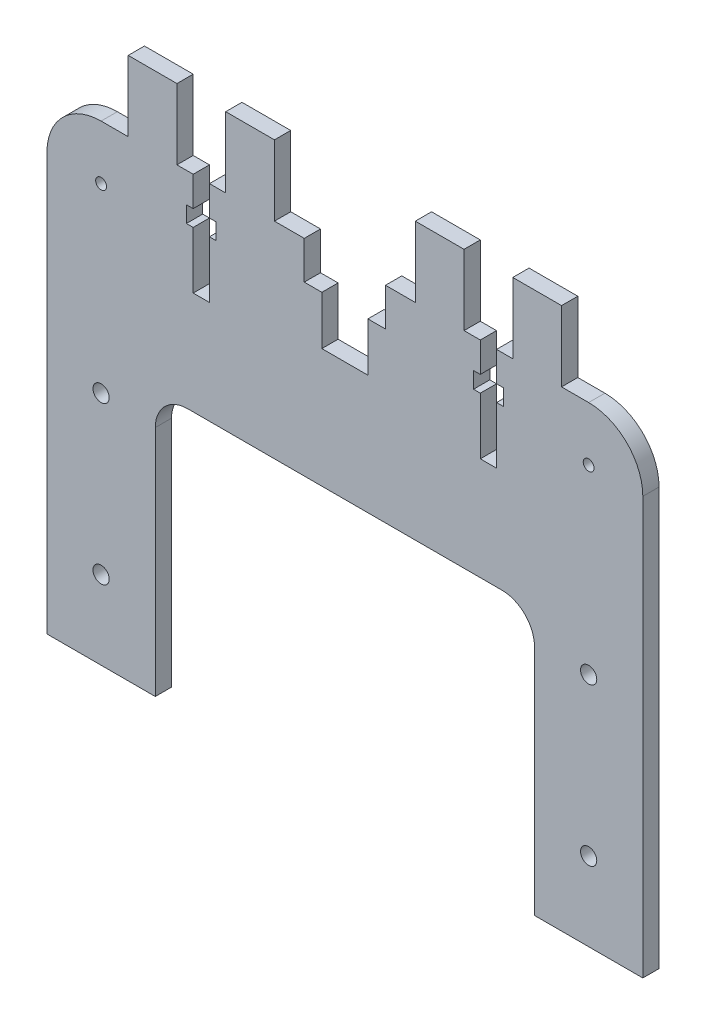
ISO-10303-21;
HEADER;
FILE_DESCRIPTION(('STEP AP214'),'2;1');
FILE_NAME('part.step','',(''),(''),'','','');
FILE_SCHEMA(('AUTOMOTIVE_DESIGN { 1 0 10303 214 1 1 1 1 }'));
ENDSEC;
DATA;
#1=APPLICATION_CONTEXT('core data for automotive mechanical design processes');
#2=APPLICATION_PROTOCOL_DEFINITION('international standard','automotive_design',2000,#1);
#3=PRODUCT_CONTEXT('',#1,'mechanical');
#4=PRODUCT('Part','Part','',(#3));
#5=PRODUCT_RELATED_PRODUCT_CATEGORY('part','',(#4));
#6=PRODUCT_DEFINITION_FORMATION('','',#4);
#7=PRODUCT_DEFINITION_CONTEXT('part definition',#1,'design');
#8=PRODUCT_DEFINITION('design','',#6,#7);
#9=PRODUCT_DEFINITION_SHAPE('','',#8);
#10=(LENGTH_UNIT() NAMED_UNIT(*) SI_UNIT(.MILLI.,.METRE.));
#11=(NAMED_UNIT(*) PLANE_ANGLE_UNIT() SI_UNIT($,.RADIAN.));
#12=(NAMED_UNIT(*) SI_UNIT($,.STERADIAN.) SOLID_ANGLE_UNIT());
#13=UNCERTAINTY_MEASURE_WITH_UNIT(LENGTH_MEASURE(1.E-05),#10,'distance_accuracy_value','');
#14=(GEOMETRIC_REPRESENTATION_CONTEXT(3) GLOBAL_UNCERTAINTY_ASSIGNED_CONTEXT((#13)) GLOBAL_UNIT_ASSIGNED_CONTEXT((#10,
#11,#12)) REPRESENTATION_CONTEXT('',''));
#15=CARTESIAN_POINT('',(0.,0.,0.));
#16=DIRECTION('',(0.,0.,1.));
#17=DIRECTION('',(1.,0.,0.));
#18=AXIS2_PLACEMENT_3D('',#15,#16,#17);
#19=CARTESIAN_POINT('',(-83.9370204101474,-5.82430079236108E-13,3.));
#20=DIRECTION('',(1.,0.,0.));
#21=DIRECTION('',(0.,1.,0.));
#22=AXIS2_PLACEMENT_3D('',#19,#20,#21);
#23=PLANE('',#22);
#24=DIRECTION('',(0.,-1.,0.));
#25=VECTOR('',#24,1.);
#26=CARTESIAN_POINT('',(-83.9370204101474,-5.82430079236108E-13,0.));
#27=LINE('',#26,#25);
#28=CARTESIAN_POINT('',(-83.9370204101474,0.372536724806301,0.));
#29=VERTEX_POINT('',#28);
#30=CARTESIAN_POINT('',(-83.9370204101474,-8.6274632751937,0.));
#31=VERTEX_POINT('',#30);
#32=EDGE_CURVE('E414',#29,#31,#27,.T.);
#33=ORIENTED_EDGE('',*,*,#32,.F.);
#34=DIRECTION('',(0.,0.,-1.));
#35=VECTOR('',#34,1.);
#36=CARTESIAN_POINT('',(-83.9370204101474,0.372536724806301,3.));
#37=LINE('',#36,#35);
#38=CARTESIAN_POINT('',(-83.9370204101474,0.372536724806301,3.));
#39=VERTEX_POINT('',#38);
#40=EDGE_CURVE('E409',#39,#29,#37,.T.);
#41=ORIENTED_EDGE('',*,*,#40,.F.);
#42=DIRECTION('',(0.,-1.,0.));
#43=VECTOR('',#42,1.);
#44=CARTESIAN_POINT('',(-83.9370204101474,-5.82430079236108E-13,3.));
#45=LINE('',#44,#43);
#46=CARTESIAN_POINT('',(-83.9370204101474,-8.6274632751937,3.));
#47=VERTEX_POINT('',#46);
#48=EDGE_CURVE('E411',#39,#47,#45,.T.);
#49=ORIENTED_EDGE('',*,*,#48,.T.);
#50=DIRECTION('',(0.,0.,-1.));
#51=VECTOR('',#50,1.);
#52=CARTESIAN_POINT('',(-83.9370204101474,-8.6274632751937,3.));
#53=LINE('',#52,#51);
#54=EDGE_CURVE('E548',#47,#31,#53,.T.);
#55=ORIENTED_EDGE('',*,*,#54,.T.);
#56=EDGE_LOOP('',(#33,#41,#49,#55));
#57=FACE_BOUND('',#56,.T.);
#58=ADVANCED_FACE('F34',(#57),#23,.T.);
#59=CARTESIAN_POINT('',(0.,0.372536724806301,3.));
#60=DIRECTION('',(0.,1.,0.));
#61=DIRECTION('',(0.,0.,1.));
#62=AXIS2_PLACEMENT_3D('',#59,#60,#61);
#63=PLANE('',#62);
#64=DIRECTION('',(1.,0.,0.));
#65=VECTOR('',#64,1.);
#66=CARTESIAN_POINT('',(0.,0.372536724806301,0.));
#67=LINE('',#66,#65);
#68=CARTESIAN_POINT('',(-87.1870204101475,0.372536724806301,0.));
#69=VERTEX_POINT('',#68);
#70=EDGE_CURVE('E550',#69,#29,#67,.T.);
#71=ORIENTED_EDGE('',*,*,#70,.F.);
#72=DIRECTION('',(0.,0.,-1.));
#73=VECTOR('',#72,1.);
#74=CARTESIAN_POINT('',(-87.1870204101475,0.372536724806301,3.));
#75=LINE('',#74,#73);
#76=CARTESIAN_POINT('',(-87.1870204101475,0.372536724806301,3.));
#77=VERTEX_POINT('',#76);
#78=EDGE_CURVE('E420',#77,#69,#75,.T.);
#79=ORIENTED_EDGE('',*,*,#78,.F.);
#80=DIRECTION('',(1.,0.,0.));
#81=VECTOR('',#80,1.);
#82=CARTESIAN_POINT('',(0.,0.372536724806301,3.));
#83=LINE('',#82,#81);
#84=EDGE_CURVE('E427',#77,#39,#83,.T.);
#85=ORIENTED_EDGE('',*,*,#84,.T.);
#86=ORIENTED_EDGE('',*,*,#40,.T.);
#87=EDGE_LOOP('',(#71,#79,#85,#86));
#88=FACE_BOUND('',#87,.T.);
#89=ADVANCED_FACE('F433',(#88),#63,.T.);
#90=CARTESIAN_POINT('',(-87.1870204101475,-6.04981484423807E-13,3.));
#91=DIRECTION('',(1.,0.,0.));
#92=DIRECTION('',(0.,1.,0.));
#93=AXIS2_PLACEMENT_3D('',#90,#91,#92);
#94=PLANE('',#93);
#95=DIRECTION('',(0.,-1.,0.));
#96=VECTOR('',#95,1.);
#97=CARTESIAN_POINT('',(-87.1870204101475,-6.04981484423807E-13,0.));
#98=LINE('',#97,#96);
#99=CARTESIAN_POINT('',(-87.1870204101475,7.37253672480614,0.));
#100=VERTEX_POINT('',#99);
#101=EDGE_CURVE('E553',#100,#69,#98,.T.);
#102=ORIENTED_EDGE('',*,*,#101,.F.);
#103=DIRECTION('',(0.,0.,-1.));
#104=VECTOR('',#103,1.);
#105=CARTESIAN_POINT('',(-87.1870204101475,7.37253672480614,3.));
#106=LINE('',#105,#104);
#107=CARTESIAN_POINT('',(-87.1870204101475,7.37253672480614,3.));
#108=VERTEX_POINT('',#107);
#109=EDGE_CURVE('E788',#108,#100,#106,.T.);
#110=ORIENTED_EDGE('',*,*,#109,.F.);
#111=DIRECTION('',(0.,-1.,0.));
#112=VECTOR('',#111,1.);
#113=CARTESIAN_POINT('',(-87.1870204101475,-6.04981484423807E-13,3.));
#114=LINE('',#113,#112);
#115=EDGE_CURVE('E434',#108,#77,#114,.T.);
#116=ORIENTED_EDGE('',*,*,#115,.T.);
#117=ORIENTED_EDGE('',*,*,#78,.T.);
#118=EDGE_LOOP('',(#102,#110,#116,#117));
#119=FACE_BOUND('',#118,.T.);
#120=ADVANCED_FACE('F955',(#119),#94,.T.);
#121=CARTESIAN_POINT('',(0.,7.37253672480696,3.));
#122=DIRECTION('',(0.,1.,0.));
#123=DIRECTION('',(-1.,0.,0.));
#124=AXIS2_PLACEMENT_3D('',#121,#122,#123);
#125=PLANE('',#124);
#126=DIRECTION('',(1.,0.,0.));
#127=VECTOR('',#126,1.);
#128=CARTESIAN_POINT('',(0.,7.37253672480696,0.));
#129=LINE('',#128,#127);
#130=CARTESIAN_POINT('',(-92.6870204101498,7.37253672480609,0.));
#131=VERTEX_POINT('',#130);
#132=EDGE_CURVE('E556',#131,#100,#129,.T.);
#133=ORIENTED_EDGE('',*,*,#132,.F.);
#134=DIRECTION('',(0.,0.,-1.));
#135=VECTOR('',#134,1.);
#136=CARTESIAN_POINT('',(-92.6870204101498,7.37253672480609,3.));
#137=LINE('',#136,#135);
#138=CARTESIAN_POINT('',(-92.6870204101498,7.37253672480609,3.));
#139=VERTEX_POINT('',#138);
#140=EDGE_CURVE('E786',#139,#131,#137,.T.);
#141=ORIENTED_EDGE('',*,*,#140,.F.);
#142=DIRECTION('',(1.,0.,0.));
#143=VECTOR('',#142,1.);
#144=CARTESIAN_POINT('',(0.,7.37253672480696,3.));
#145=LINE('',#144,#143);
#146=EDGE_CURVE('E436',#139,#108,#145,.T.);
#147=ORIENTED_EDGE('',*,*,#146,.T.);
#148=ORIENTED_EDGE('',*,*,#109,.T.);
#149=EDGE_LOOP('',(#133,#141,#147,#148));
#150=FACE_BOUND('',#149,.T.);
#151=ADVANCED_FACE('F948',(#150),#125,.T.);
#152=CARTESIAN_POINT('',(-92.6870204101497,-6.92618124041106E-13,3.));
#153=DIRECTION('',(1.,0.,0.));
#154=DIRECTION('',(0.,1.,0.));
#155=AXIS2_PLACEMENT_3D('',#152,#153,#154);
#156=PLANE('',#155);
#157=DIRECTION('',(0.,-1.,0.));
#158=VECTOR('',#157,1.);
#159=CARTESIAN_POINT('',(-92.6870204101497,-6.92618124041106E-13,0.));
#160=LINE('',#159,#158);
#161=CARTESIAN_POINT('',(-92.6870204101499,20.3725367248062,0.));
#162=VERTEX_POINT('',#161);
#163=EDGE_CURVE('E559',#162,#131,#160,.T.);
#164=ORIENTED_EDGE('',*,*,#163,.F.);
#165=DIRECTION('',(0.,0.,-1.));
#166=VECTOR('',#165,1.);
#167=CARTESIAN_POINT('',(-92.6870204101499,20.3725367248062,3.));
#168=LINE('',#167,#166);
#169=CARTESIAN_POINT('',(-92.6870204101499,20.3725367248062,3.));
#170=VERTEX_POINT('',#169);
#171=EDGE_CURVE('E784',#170,#162,#168,.T.);
#172=ORIENTED_EDGE('',*,*,#171,.F.);
#173=DIRECTION('',(0.,-1.,0.));
#174=VECTOR('',#173,1.);
#175=CARTESIAN_POINT('',(-92.6870204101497,-6.92618124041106E-13,3.));
#176=LINE('',#175,#174);
#177=EDGE_CURVE('E442',#170,#139,#176,.T.);
#178=ORIENTED_EDGE('',*,*,#177,.T.);
#179=ORIENTED_EDGE('',*,*,#140,.T.);
#180=EDGE_LOOP('',(#164,#172,#178,#179));
#181=FACE_BOUND('',#180,.T.);
#182=ADVANCED_FACE('F1579',(#181),#156,.T.);
#183=CARTESIAN_POINT('',(0.,20.3725367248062,3.));
#184=DIRECTION('',(0.,1.,0.));
#185=DIRECTION('',(0.,0.,1.));
#186=AXIS2_PLACEMENT_3D('',#183,#184,#185);
#187=PLANE('',#186);
#188=DIRECTION('',(1.,0.,0.));
#189=VECTOR('',#188,1.);
#190=CARTESIAN_POINT('',(0.,20.3725367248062,0.));
#191=LINE('',#190,#189);
#192=CARTESIAN_POINT('',(-101.68702041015,20.3725367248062,0.));
#193=VERTEX_POINT('',#192);
#194=EDGE_CURVE('E564',#193,#162,#191,.T.);
#195=ORIENTED_EDGE('',*,*,#194,.F.);
#196=DIRECTION('',(0.,0.,-1.));
#197=VECTOR('',#196,1.);
#198=CARTESIAN_POINT('',(-101.68702041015,20.3725367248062,3.));
#199=LINE('',#198,#197);
#200=CARTESIAN_POINT('',(-101.68702041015,20.3725367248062,3.));
#201=VERTEX_POINT('',#200);
#202=EDGE_CURVE('E782',#201,#193,#199,.T.);
#203=ORIENTED_EDGE('',*,*,#202,.F.);
#204=DIRECTION('',(1.,0.,0.));
#205=VECTOR('',#204,1.);
#206=CARTESIAN_POINT('',(0.,20.3725367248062,3.));
#207=LINE('',#206,#205);
#208=EDGE_CURVE('E447',#201,#170,#207,.T.);
#209=ORIENTED_EDGE('',*,*,#208,.T.);
#210=ORIENTED_EDGE('',*,*,#171,.T.);
#211=EDGE_LOOP('',(#195,#203,#209,#210));
#212=FACE_BOUND('',#211,.T.);
#213=ADVANCED_FACE('F1569',(#212),#187,.T.);
#214=CARTESIAN_POINT('',(-101.68702041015,-7.59872018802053E-13,3.));
#215=DIRECTION('',(1.,0.,0.));
#216=DIRECTION('',(0.,1.,0.));
#217=AXIS2_PLACEMENT_3D('',#214,#215,#216);
#218=PLANE('',#217);
#219=DIRECTION('',(0.,-1.,0.));
#220=VECTOR('',#219,1.);
#221=CARTESIAN_POINT('',(-101.68702041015,-7.59872018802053E-13,0.));
#222=LINE('',#221,#220);
#223=CARTESIAN_POINT('',(-101.68702041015,7.37253672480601,0.));
#224=VERTEX_POINT('',#223);
#225=EDGE_CURVE('E567',#193,#224,#222,.T.);
#226=ORIENTED_EDGE('',*,*,#225,.T.);
#227=DIRECTION('',(0.,0.,-1.));
#228=VECTOR('',#227,1.);
#229=CARTESIAN_POINT('',(-101.68702041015,7.37253672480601,3.));
#230=LINE('',#229,#228);
#231=CARTESIAN_POINT('',(-101.68702041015,7.37253672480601,3.));
#232=VERTEX_POINT('',#231);
#233=EDGE_CURVE('E780',#232,#224,#230,.T.);
#234=ORIENTED_EDGE('',*,*,#233,.F.);
#235=DIRECTION('',(0.,-1.,0.));
#236=VECTOR('',#235,1.);
#237=CARTESIAN_POINT('',(-101.68702041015,-7.59872018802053E-13,3.));
#238=LINE('',#237,#236);
#239=EDGE_CURVE('E450',#201,#232,#238,.T.);
#240=ORIENTED_EDGE('',*,*,#239,.F.);
#241=ORIENTED_EDGE('',*,*,#202,.T.);
#242=EDGE_LOOP('',(#226,#234,#240,#241));
#243=FACE_BOUND('',#242,.T.);
#244=ADVANCED_FACE('F1560',(#243),#218,.F.);
#245=CARTESIAN_POINT('',(-104.68702041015,7.37253672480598,0.));
#246=VERTEX_POINT('',#245);
#247=EDGE_CURVE('E561',#246,#224,#129,.T.);
#248=ORIENTED_EDGE('',*,*,#247,.F.);
#249=DIRECTION('',(0.,0.,-1.));
#250=VECTOR('',#249,1.);
#251=CARTESIAN_POINT('',(-104.68702041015,7.37253672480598,3.));
#252=LINE('',#251,#250);
#253=CARTESIAN_POINT('',(-104.68702041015,7.37253672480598,3.));
#254=VERTEX_POINT('',#253);
#255=EDGE_CURVE('E778',#254,#246,#252,.T.);
#256=ORIENTED_EDGE('',*,*,#255,.F.);
#257=EDGE_CURVE('E444',#254,#232,#145,.T.);
#258=ORIENTED_EDGE('',*,*,#257,.T.);
#259=ORIENTED_EDGE('',*,*,#233,.T.);
#260=EDGE_LOOP('',(#248,#256,#258,#259));
#261=FACE_BOUND('',#260,.T.);
#262=ADVANCED_FACE('F869',(#261),#125,.T.);
#263=CARTESIAN_POINT('',(-104.68702041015,-7.26412127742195E-13,3.));
#264=DIRECTION('',(-1.,0.,0.));
#265=DIRECTION('',(0.,-1.,0.));
#266=AXIS2_PLACEMENT_3D('',#263,#264,#265);
#267=PLANE('',#266);
#268=DIRECTION('',(0.,1.,0.));
#269=VECTOR('',#268,1.);
#270=CARTESIAN_POINT('',(-104.68702041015,-7.26412127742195E-13,0.));
#271=LINE('',#270,#269);
#272=CARTESIAN_POINT('',(-104.68702041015,1.8725367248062,0.));
#273=VERTEX_POINT('',#272);
#274=EDGE_CURVE('E570',#273,#246,#271,.T.);
#275=ORIENTED_EDGE('',*,*,#274,.F.);
#276=DIRECTION('',(0.,0.,-1.));
#277=VECTOR('',#276,1.);
#278=CARTESIAN_POINT('',(-104.68702041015,1.8725367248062,3.));
#279=LINE('',#278,#277);
#280=CARTESIAN_POINT('',(-104.68702041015,1.8725367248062,3.));
#281=VERTEX_POINT('',#280);
#282=EDGE_CURVE('E776',#281,#273,#279,.T.);
#283=ORIENTED_EDGE('',*,*,#282,.F.);
#284=DIRECTION('',(0.,1.,0.));
#285=VECTOR('',#284,1.);
#286=CARTESIAN_POINT('',(-104.68702041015,-7.26412127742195E-13,3.));
#287=LINE('',#286,#285);
#288=EDGE_CURVE('E452',#281,#254,#287,.T.);
#289=ORIENTED_EDGE('',*,*,#288,.T.);
#290=ORIENTED_EDGE('',*,*,#255,.T.);
#291=EDGE_LOOP('',(#275,#283,#289,#290));
#292=FACE_BOUND('',#291,.T.);
#293=ADVANCED_FACE('F877',(#292),#267,.T.);
#294=CARTESIAN_POINT('',(0.,1.8725367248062,3.));
#295=DIRECTION('',(0.,-1.,0.));
#296=DIRECTION('',(0.,0.,-1.));
#297=AXIS2_PLACEMENT_3D('',#294,#295,#296);
#298=PLANE('',#297);
#299=DIRECTION('',(-1.,0.,0.));
#300=VECTOR('',#299,1.);
#301=CARTESIAN_POINT('',(0.,1.8725367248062,0.));
#302=LINE('',#301,#300);
#303=CARTESIAN_POINT('',(-103.43702041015,1.8725367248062,0.));
#304=VERTEX_POINT('',#303);
#305=EDGE_CURVE('E573',#304,#273,#302,.T.);
#306=ORIENTED_EDGE('',*,*,#305,.F.);
#307=DIRECTION('',(0.,0.,-1.));
#308=VECTOR('',#307,1.);
#309=CARTESIAN_POINT('',(-103.43702041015,1.8725367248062,3.));
#310=LINE('',#309,#308);
#311=CARTESIAN_POINT('',(-103.43702041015,1.8725367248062,3.));
#312=VERTEX_POINT('',#311);
#313=EDGE_CURVE('E774',#312,#304,#310,.T.);
#314=ORIENTED_EDGE('',*,*,#313,.F.);
#315=DIRECTION('',(-1.,0.,0.));
#316=VECTOR('',#315,1.);
#317=CARTESIAN_POINT('',(0.,1.8725367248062,3.));
#318=LINE('',#317,#316);
#319=EDGE_CURVE('E455',#312,#281,#318,.T.);
#320=ORIENTED_EDGE('',*,*,#319,.T.);
#321=ORIENTED_EDGE('',*,*,#282,.T.);
#322=EDGE_LOOP('',(#306,#314,#320,#321));
#323=FACE_BOUND('',#322,.T.);
#324=ADVANCED_FACE('F880',(#323),#298,.T.);
#325=CARTESIAN_POINT('',(-103.43702041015,-4.78492340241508E-13,3.));
#326=DIRECTION('',(-1.,0.,0.));
#327=DIRECTION('',(0.,-1.,0.));
#328=AXIS2_PLACEMENT_3D('',#325,#326,#327);
#329=PLANE('',#328);
#330=DIRECTION('',(0.,1.,0.));
#331=VECTOR('',#330,1.);
#332=CARTESIAN_POINT('',(-103.43702041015,-4.78492340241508E-13,0.));
#333=LINE('',#332,#331);
#334=CARTESIAN_POINT('',(-103.43702041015,-1.12746327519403,0.));
#335=VERTEX_POINT('',#334);
#336=EDGE_CURVE('E577',#335,#304,#333,.T.);
#337=ORIENTED_EDGE('',*,*,#336,.F.);
#338=DIRECTION('',(0.,0.,-1.));
#339=VECTOR('',#338,1.);
#340=CARTESIAN_POINT('',(-103.43702041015,-1.12746327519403,3.));
#341=LINE('',#340,#339);
#342=CARTESIAN_POINT('',(-103.43702041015,-1.12746327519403,3.));
#343=VERTEX_POINT('',#342);
#344=EDGE_CURVE('E772',#343,#335,#341,.T.);
#345=ORIENTED_EDGE('',*,*,#344,.F.);
#346=DIRECTION('',(0.,1.,0.));
#347=VECTOR('',#346,1.);
#348=CARTESIAN_POINT('',(-103.43702041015,-4.78492340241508E-13,3.));
#349=LINE('',#348,#347);
#350=EDGE_CURVE('E459',#343,#312,#349,.T.);
#351=ORIENTED_EDGE('',*,*,#350,.T.);
#352=ORIENTED_EDGE('',*,*,#313,.T.);
#353=EDGE_LOOP('',(#337,#345,#351,#352));
#354=FACE_BOUND('',#353,.T.);
#355=ADVANCED_FACE('F884',(#354),#329,.T.);
#356=CARTESIAN_POINT('',(0.,-1.12746327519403,3.));
#357=DIRECTION('',(0.,-1.,0.));
#358=DIRECTION('',(0.,0.,-1.));
#359=AXIS2_PLACEMENT_3D('',#356,#357,#358);
#360=PLANE('',#359);
#361=DIRECTION('',(-1.,0.,0.));
#362=VECTOR('',#361,1.);
#363=CARTESIAN_POINT('',(0.,-1.12746327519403,0.));
#364=LINE('',#363,#362);
#365=CARTESIAN_POINT('',(-104.68702041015,-1.12746327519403,0.));
#366=VERTEX_POINT('',#365);
#367=EDGE_CURVE('E581',#335,#366,#364,.T.);
#368=ORIENTED_EDGE('',*,*,#367,.T.);
#369=DIRECTION('',(0.,0.,-1.));
#370=VECTOR('',#369,1.);
#371=CARTESIAN_POINT('',(-104.68702041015,-1.12746327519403,3.));
#372=LINE('',#371,#370);
#373=CARTESIAN_POINT('',(-104.68702041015,-1.12746327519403,3.));
#374=VERTEX_POINT('',#373);
#375=EDGE_CURVE('E770',#374,#366,#372,.T.);
#376=ORIENTED_EDGE('',*,*,#375,.F.);
#377=DIRECTION('',(-1.,0.,0.));
#378=VECTOR('',#377,1.);
#379=CARTESIAN_POINT('',(0.,-1.12746327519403,3.));
#380=LINE('',#379,#378);
#381=EDGE_CURVE('E463',#343,#374,#380,.T.);
#382=ORIENTED_EDGE('',*,*,#381,.F.);
#383=ORIENTED_EDGE('',*,*,#344,.T.);
#384=EDGE_LOOP('',(#368,#376,#382,#383));
#385=FACE_BOUND('',#384,.T.);
#386=ADVANCED_FACE('F889',(#385),#360,.F.);
#387=CARTESIAN_POINT('',(-104.68702041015,-11.627463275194,0.));
#388=VERTEX_POINT('',#387);
#389=EDGE_CURVE('E574',#388,#366,#271,.T.);
#390=ORIENTED_EDGE('',*,*,#389,.F.);
#391=DIRECTION('',(0.,0.,-1.));
#392=VECTOR('',#391,1.);
#393=CARTESIAN_POINT('',(-104.68702041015,-11.627463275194,3.));
#394=LINE('',#393,#392);
#395=CARTESIAN_POINT('',(-104.68702041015,-11.627463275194,3.));
#396=VERTEX_POINT('',#395);
#397=EDGE_CURVE('E768',#396,#388,#394,.T.);
#398=ORIENTED_EDGE('',*,*,#397,.F.);
#399=EDGE_CURVE('E456',#396,#374,#287,.T.);
#400=ORIENTED_EDGE('',*,*,#399,.T.);
#401=ORIENTED_EDGE('',*,*,#375,.T.);
#402=EDGE_LOOP('',(#390,#398,#400,#401));
#403=FACE_BOUND('',#402,.T.);
#404=ADVANCED_FACE('F896',(#403),#267,.T.);
#405=CARTESIAN_POINT('',(0.,-11.627463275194,3.));
#406=DIRECTION('',(0.,-1.,0.));
#407=DIRECTION('',(0.,0.,-1.));
#408=AXIS2_PLACEMENT_3D('',#405,#406,#407);
#409=PLANE('',#408);
#410=DIRECTION('',(-1.,0.,0.));
#411=VECTOR('',#410,1.);
#412=CARTESIAN_POINT('',(0.,-11.627463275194,0.));
#413=LINE('',#412,#411);
#414=CARTESIAN_POINT('',(-107.68702041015,-11.627463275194,0.));
#415=VERTEX_POINT('',#414);
#416=EDGE_CURVE('E585',#388,#415,#413,.T.);
#417=ORIENTED_EDGE('',*,*,#416,.T.);
#418=DIRECTION('',(0.,0.,-1.));
#419=VECTOR('',#418,1.);
#420=CARTESIAN_POINT('',(-107.68702041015,-11.627463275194,3.));
#421=LINE('',#420,#419);
#422=CARTESIAN_POINT('',(-107.68702041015,-11.627463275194,3.));
#423=VERTEX_POINT('',#422);
#424=EDGE_CURVE('E765',#423,#415,#421,.T.);
#425=ORIENTED_EDGE('',*,*,#424,.F.);
#426=DIRECTION('',(-1.,0.,0.));
#427=VECTOR('',#426,1.);
#428=CARTESIAN_POINT('',(0.,-11.627463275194,3.));
#429=LINE('',#428,#427);
#430=EDGE_CURVE('E466',#396,#423,#429,.T.);
#431=ORIENTED_EDGE('',*,*,#430,.F.);
#432=ORIENTED_EDGE('',*,*,#397,.T.);
#433=EDGE_LOOP('',(#417,#425,#431,#432));
#434=FACE_BOUND('',#433,.T.);
#435=ADVANCED_FACE('F900',(#434),#409,.F.);
#436=CARTESIAN_POINT('',(-107.68702041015,-7.47228809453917E-13,3.));
#437=DIRECTION('',(-1.,0.,0.));
#438=DIRECTION('',(0.,-1.,0.));
#439=AXIS2_PLACEMENT_3D('',#436,#437,#438);
#440=PLANE('',#439);
#441=DIRECTION('',(0.,1.,0.));
#442=VECTOR('',#441,1.);
#443=CARTESIAN_POINT('',(-107.68702041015,-7.47228809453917E-13,0.));
#444=LINE('',#443,#442);
#445=CARTESIAN_POINT('',(-107.68702041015,-1.12746327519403,0.));
#446=VERTEX_POINT('',#445);
#447=EDGE_CURVE('E587',#415,#446,#444,.T.);
#448=ORIENTED_EDGE('',*,*,#447,.T.);
#449=DIRECTION('',(0.,0.,-1.));
#450=VECTOR('',#449,1.);
#451=CARTESIAN_POINT('',(-107.68702041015,-1.12746327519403,3.));
#452=LINE('',#451,#450);
#453=CARTESIAN_POINT('',(-107.68702041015,-1.12746327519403,3.));
#454=VERTEX_POINT('',#453);
#455=EDGE_CURVE('E762',#454,#446,#452,.T.);
#456=ORIENTED_EDGE('',*,*,#455,.F.);
#457=DIRECTION('',(0.,1.,0.));
#458=VECTOR('',#457,1.);
#459=CARTESIAN_POINT('',(-107.68702041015,-7.47228809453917E-13,3.));
#460=LINE('',#459,#458);
#461=EDGE_CURVE('E468',#423,#454,#460,.T.);
#462=ORIENTED_EDGE('',*,*,#461,.F.);
#463=ORIENTED_EDGE('',*,*,#424,.T.);
#464=EDGE_LOOP('',(#448,#456,#462,#463));
#465=FACE_BOUND('',#464,.T.);
#466=ADVANCED_FACE('F905',(#465),#440,.F.);
#467=CARTESIAN_POINT('',(-108.93702041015,-1.12746327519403,0.));
#468=VERTEX_POINT('',#467);
#469=EDGE_CURVE('E584',#446,#468,#364,.T.);
#470=ORIENTED_EDGE('',*,*,#469,.T.);
#471=DIRECTION('',(0.,0.,-1.));
#472=VECTOR('',#471,1.);
#473=CARTESIAN_POINT('',(-108.93702041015,-1.12746327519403,3.));
#474=LINE('',#473,#472);
#475=CARTESIAN_POINT('',(-108.93702041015,-1.12746327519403,3.));
#476=VERTEX_POINT('',#475);
#477=EDGE_CURVE('E759',#476,#468,#474,.T.);
#478=ORIENTED_EDGE('',*,*,#477,.F.);
#479=EDGE_CURVE('E465',#454,#476,#380,.T.);
#480=ORIENTED_EDGE('',*,*,#479,.F.);
#481=ORIENTED_EDGE('',*,*,#455,.T.);
#482=EDGE_LOOP('',(#470,#478,#480,#481));
#483=FACE_BOUND('',#482,.T.);
#484=ADVANCED_FACE('F912',(#483),#360,.F.);
#485=CARTESIAN_POINT('',(-108.93702041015,-5.03934951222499E-13,3.));
#486=DIRECTION('',(-1.,0.,0.));
#487=DIRECTION('',(0.,-1.,0.));
#488=AXIS2_PLACEMENT_3D('',#485,#486,#487);
#489=PLANE('',#488);
#490=DIRECTION('',(0.,1.,0.));
#491=VECTOR('',#490,1.);
#492=CARTESIAN_POINT('',(-108.93702041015,-5.03934951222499E-13,0.));
#493=LINE('',#492,#491);
#494=CARTESIAN_POINT('',(-108.93702041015,1.8725367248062,0.));
#495=VERTEX_POINT('',#494);
#496=EDGE_CURVE('E590',#468,#495,#493,.T.);
#497=ORIENTED_EDGE('',*,*,#496,.T.);
#498=DIRECTION('',(0.,0.,-1.));
#499=VECTOR('',#498,1.);
#500=CARTESIAN_POINT('',(-108.93702041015,1.8725367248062,3.));
#501=LINE('',#500,#499);
#502=CARTESIAN_POINT('',(-108.93702041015,1.8725367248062,3.));
#503=VERTEX_POINT('',#502);
#504=EDGE_CURVE('E757',#503,#495,#501,.T.);
#505=ORIENTED_EDGE('',*,*,#504,.F.);
#506=DIRECTION('',(0.,1.,0.));
#507=VECTOR('',#506,1.);
#508=CARTESIAN_POINT('',(-108.93702041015,-5.03934951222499E-13,3.));
#509=LINE('',#508,#507);
#510=EDGE_CURVE('E471',#476,#503,#509,.T.);
#511=ORIENTED_EDGE('',*,*,#510,.F.);
#512=ORIENTED_EDGE('',*,*,#477,.T.);
#513=EDGE_LOOP('',(#497,#505,#511,#512));
#514=FACE_BOUND('',#513,.T.);
#515=ADVANCED_FACE('F916',(#514),#489,.F.);
#516=CARTESIAN_POINT('',(-107.68702041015,1.8725367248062,0.));
#517=VERTEX_POINT('',#516);
#518=EDGE_CURVE('E578',#517,#495,#302,.T.);
#519=ORIENTED_EDGE('',*,*,#518,.F.);
#520=DIRECTION('',(0.,0.,-1.));
#521=VECTOR('',#520,1.);
#522=CARTESIAN_POINT('',(-107.68702041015,1.8725367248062,3.));
#523=LINE('',#522,#521);
#524=CARTESIAN_POINT('',(-107.68702041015,1.8725367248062,3.));
#525=VERTEX_POINT('',#524);
#526=EDGE_CURVE('E755',#525,#517,#523,.T.);
#527=ORIENTED_EDGE('',*,*,#526,.F.);
#528=EDGE_CURVE('E460',#525,#503,#318,.T.);
#529=ORIENTED_EDGE('',*,*,#528,.T.);
#530=ORIENTED_EDGE('',*,*,#504,.T.);
#531=EDGE_LOOP('',(#519,#527,#529,#530));
#532=FACE_BOUND('',#531,.T.);
#533=ADVANCED_FACE('F921',(#532),#298,.T.);
#534=CARTESIAN_POINT('',(-107.68702041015,7.37253672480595,0.));
#535=VERTEX_POINT('',#534);
#536=EDGE_CURVE('E589',#517,#535,#444,.T.);
#537=ORIENTED_EDGE('',*,*,#536,.T.);
#538=DIRECTION('',(0.,0.,-1.));
#539=VECTOR('',#538,1.);
#540=CARTESIAN_POINT('',(-107.68702041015,7.37253672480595,3.));
#541=LINE('',#540,#539);
#542=CARTESIAN_POINT('',(-107.68702041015,7.37253672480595,3.));
#543=VERTEX_POINT('',#542);
#544=EDGE_CURVE('E753',#543,#535,#541,.T.);
#545=ORIENTED_EDGE('',*,*,#544,.F.);
#546=EDGE_CURVE('E470',#525,#543,#460,.T.);
#547=ORIENTED_EDGE('',*,*,#546,.F.);
#548=ORIENTED_EDGE('',*,*,#526,.T.);
#549=EDGE_LOOP('',(#537,#545,#547,#548));
#550=FACE_BOUND('',#549,.T.);
#551=ADVANCED_FACE('F927',(#550),#440,.F.);
#552=CARTESIAN_POINT('',(-110.68702041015,7.37253672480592,0.));
#553=VERTEX_POINT('',#552);
#554=EDGE_CURVE('E597',#553,#535,#129,.T.);
#555=ORIENTED_EDGE('',*,*,#554,.F.);
#556=DIRECTION('',(0.,0.,-1.));
#557=VECTOR('',#556,1.);
#558=CARTESIAN_POINT('',(-110.68702041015,7.37253672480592,3.));
#559=LINE('',#558,#557);
#560=CARTESIAN_POINT('',(-110.68702041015,7.37253672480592,3.));
#561=VERTEX_POINT('',#560);
#562=EDGE_CURVE('E751',#561,#553,#559,.T.);
#563=ORIENTED_EDGE('',*,*,#562,.F.);
#564=EDGE_CURVE('E477',#561,#543,#145,.T.);
#565=ORIENTED_EDGE('',*,*,#564,.T.);
#566=ORIENTED_EDGE('',*,*,#544,.T.);
#567=EDGE_LOOP('',(#555,#563,#565,#566));
#568=FACE_BOUND('',#567,.T.);
#569=ADVANCED_FACE('F931',(#568),#125,.T.);
#570=CARTESIAN_POINT('',(-110.68702041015,-8.27125913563E-13,3.));
#571=DIRECTION('',(1.,0.,0.));
#572=DIRECTION('',(0.,1.,0.));
#573=AXIS2_PLACEMENT_3D('',#570,#571,#572);
#574=PLANE('',#573);
#575=DIRECTION('',(0.,-1.,0.));
#576=VECTOR('',#575,1.);
#577=CARTESIAN_POINT('',(-110.68702041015,-8.27125913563E-13,0.));
#578=LINE('',#577,#576);
#579=CARTESIAN_POINT('',(-110.68702041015,20.3725367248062,0.));
#580=VERTEX_POINT('',#579);
#581=EDGE_CURVE('E593',#580,#553,#578,.T.);
#582=ORIENTED_EDGE('',*,*,#581,.F.);
#583=DIRECTION('',(0.,0.,-1.));
#584=VECTOR('',#583,1.);
#585=CARTESIAN_POINT('',(-110.68702041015,20.3725367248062,3.));
#586=LINE('',#585,#584);
#587=CARTESIAN_POINT('',(-110.68702041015,20.3725367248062,3.));
#588=VERTEX_POINT('',#587);
#589=EDGE_CURVE('E749',#588,#580,#586,.T.);
#590=ORIENTED_EDGE('',*,*,#589,.F.);
#591=DIRECTION('',(0.,-1.,0.));
#592=VECTOR('',#591,1.);
#593=CARTESIAN_POINT('',(-110.68702041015,-8.27125913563E-13,3.));
#594=LINE('',#593,#592);
#595=EDGE_CURVE('E473',#588,#561,#594,.T.);
#596=ORIENTED_EDGE('',*,*,#595,.T.);
#597=ORIENTED_EDGE('',*,*,#562,.T.);
#598=EDGE_LOOP('',(#582,#590,#596,#597));
#599=FACE_BOUND('',#598,.T.);
#600=ADVANCED_FACE('F936',(#599),#574,.T.);
#601=CARTESIAN_POINT('',(-1.00524708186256E-12,20.3725367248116,3.));
#602=DIRECTION('',(0.,1.,0.));
#603=DIRECTION('',(-1.,0.,0.));
#604=AXIS2_PLACEMENT_3D('',#601,#602,#603);
#605=PLANE('',#604);
#606=DIRECTION('',(1.,0.,0.));
#607=VECTOR('',#606,1.);
#608=CARTESIAN_POINT('',(-1.00524708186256E-12,20.3725367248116,0.));
#609=LINE('',#608,#607);
#610=CARTESIAN_POINT('',(-119.68702041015,20.3725367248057,0.));
#611=VERTEX_POINT('',#610);
#612=EDGE_CURVE('E596',#611,#580,#609,.T.);
#613=ORIENTED_EDGE('',*,*,#612,.F.);
#614=DIRECTION('',(0.,0.,-1.));
#615=VECTOR('',#614,1.);
#616=CARTESIAN_POINT('',(-119.68702041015,20.3725367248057,3.));
#617=LINE('',#616,#615);
#618=CARTESIAN_POINT('',(-119.68702041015,20.3725367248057,3.));
#619=VERTEX_POINT('',#618);
#620=EDGE_CURVE('E747',#619,#611,#617,.T.);
#621=ORIENTED_EDGE('',*,*,#620,.F.);
#622=DIRECTION('',(1.,0.,0.));
#623=VECTOR('',#622,1.);
#624=CARTESIAN_POINT('',(-1.00524708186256E-12,20.3725367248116,3.));
#625=LINE('',#624,#623);
#626=EDGE_CURVE('E476',#619,#588,#625,.T.);
#627=ORIENTED_EDGE('',*,*,#626,.T.);
#628=ORIENTED_EDGE('',*,*,#589,.T.);
#629=EDGE_LOOP('',(#613,#621,#627,#628));
#630=FACE_BOUND('',#629,.T.);
#631=ADVANCED_FACE('F938',(#630),#605,.T.);
#632=CARTESIAN_POINT('',(-119.68702041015,-8.94379808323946E-13,3.));
#633=DIRECTION('',(1.,0.,0.));
#634=DIRECTION('',(0.,1.,0.));
#635=AXIS2_PLACEMENT_3D('',#632,#633,#634);
#636=PLANE('',#635);
#637=DIRECTION('',(0.,-1.,0.));
#638=VECTOR('',#637,1.);
#639=CARTESIAN_POINT('',(-119.68702041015,-8.94379808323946E-13,0.));
#640=LINE('',#639,#638);
#641=CARTESIAN_POINT('',(-119.68702041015,7.37253672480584,0.));
#642=VERTEX_POINT('',#641);
#643=EDGE_CURVE('E600',#611,#642,#640,.T.);
#644=ORIENTED_EDGE('',*,*,#643,.T.);
#645=DIRECTION('',(0.,0.,-1.));
#646=VECTOR('',#645,1.);
#647=CARTESIAN_POINT('',(-119.68702041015,7.37253672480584,3.));
#648=LINE('',#647,#646);
#649=CARTESIAN_POINT('',(-119.68702041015,7.37253672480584,3.));
#650=VERTEX_POINT('',#649);
#651=EDGE_CURVE('E744',#650,#642,#648,.T.);
#652=ORIENTED_EDGE('',*,*,#651,.F.);
#653=DIRECTION('',(0.,-1.,0.));
#654=VECTOR('',#653,1.);
#655=CARTESIAN_POINT('',(-119.68702041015,-8.94379808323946E-13,3.));
#656=LINE('',#655,#654);
#657=EDGE_CURVE('E480',#619,#650,#656,.T.);
#658=ORIENTED_EDGE('',*,*,#657,.F.);
#659=ORIENTED_EDGE('',*,*,#620,.T.);
#660=EDGE_LOOP('',(#644,#652,#658,#659));
#661=FACE_BOUND('',#660,.T.);
#662=ADVANCED_FACE('F940',(#661),#636,.F.);
#663=CARTESIAN_POINT('',(-124.687020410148,7.37253672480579,0.));
#664=VERTEX_POINT('',#663);
#665=EDGE_CURVE('E560',#664,#642,#129,.T.);
#666=ORIENTED_EDGE('',*,*,#665,.F.);
#667=DIRECTION('',(0.,0.,-1.));
#668=VECTOR('',#667,1.);
#669=CARTESIAN_POINT('',(-124.687020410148,7.37253672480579,3.));
#670=LINE('',#669,#668);
#671=CARTESIAN_POINT('',(-124.687020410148,7.37253672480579,3.));
#672=VERTEX_POINT('',#671);
#673=EDGE_CURVE('E806',#664,#672,#670,.F.);
#674=ORIENTED_EDGE('',*,*,#673,.T.);
#675=EDGE_CURVE('E443',#672,#650,#145,.T.);
#676=ORIENTED_EDGE('',*,*,#675,.T.);
#677=ORIENTED_EDGE('',*,*,#651,.T.);
#678=EDGE_LOOP('',(#666,#674,#676,#677));
#679=FACE_BOUND('',#678,.T.);
#680=ADVANCED_FACE('F858',(#679),#125,.T.);
#681=CARTESIAN_POINT('',(-134.687020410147,-9.45321231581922E-13,3.));
#682=DIRECTION('',(1.,0.,0.));
#683=DIRECTION('',(0.,1.,0.));
#684=AXIS2_PLACEMENT_3D('',#681,#682,#683);
#685=PLANE('',#684);
#686=DIRECTION('',(0.,-1.,0.));
#687=VECTOR('',#686,1.);
#688=CARTESIAN_POINT('',(-134.687020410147,-9.45321231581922E-13,3.));
#689=LINE('',#688,#687);
#690=CARTESIAN_POINT('',(-134.687020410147,-2.62746327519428,3.));
#691=VERTEX_POINT('',#690);
#692=CARTESIAN_POINT('',(-134.687020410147,-79.6274632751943,3.));
#693=VERTEX_POINT('',#692);
#694=EDGE_CURVE('E483',#691,#693,#689,.T.);
#695=ORIENTED_EDGE('',*,*,#694,.F.);
#696=DIRECTION('',(0.,0.,-1.));
#697=VECTOR('',#696,1.);
#698=CARTESIAN_POINT('',(-134.687020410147,-2.62746327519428,0.));
#699=LINE('',#698,#697);
#700=CARTESIAN_POINT('',(-134.687020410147,-2.62746327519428,0.));
#701=VERTEX_POINT('',#700);
#702=EDGE_CURVE('E803',#691,#701,#699,.T.);
#703=ORIENTED_EDGE('',*,*,#702,.T.);
#704=DIRECTION('',(0.,-1.,0.));
#705=VECTOR('',#704,1.);
#706=CARTESIAN_POINT('',(-134.687020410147,-9.45321231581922E-13,0.));
#707=LINE('',#706,#705);
#708=CARTESIAN_POINT('',(-134.687020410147,-79.6274632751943,0.));
#709=VERTEX_POINT('',#708);
#710=EDGE_CURVE('E603',#701,#709,#707,.T.);
#711=ORIENTED_EDGE('',*,*,#710,.T.);
#712=DIRECTION('',(0.,0.,-1.));
#713=VECTOR('',#712,1.);
#714=CARTESIAN_POINT('',(-134.687020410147,-79.6274632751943,3.));
#715=LINE('',#714,#713);
#716=EDGE_CURVE('E741',#693,#709,#715,.T.);
#717=ORIENTED_EDGE('',*,*,#716,.F.);
#718=EDGE_LOOP('',(#695,#703,#711,#717));
#719=FACE_BOUND('',#718,.T.);
#720=ADVANCED_FACE('F850',(#719),#685,.F.);
#721=CARTESIAN_POINT('',(8.8404243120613E-13,-79.6274632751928,3.));
#722=DIRECTION('',(0.,1.,0.));
#723=DIRECTION('',(-1.,0.,0.));
#724=AXIS2_PLACEMENT_3D('',#721,#722,#723);
#725=PLANE('',#724);
#726=DIRECTION('',(1.,0.,0.));
#727=VECTOR('',#726,1.);
#728=CARTESIAN_POINT('',(8.8404243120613E-13,-79.6274632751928,0.));
#729=LINE('',#728,#727);
#730=CARTESIAN_POINT('',(-114.687020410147,-79.6274632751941,0.));
#731=VERTEX_POINT('',#730);
#732=EDGE_CURVE('E605',#709,#731,#729,.T.);
#733=ORIENTED_EDGE('',*,*,#732,.T.);
#734=DIRECTION('',(0.,0.,-1.));
#735=VECTOR('',#734,1.);
#736=CARTESIAN_POINT('',(-114.687020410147,-79.6274632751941,3.));
#737=LINE('',#736,#735);
#738=CARTESIAN_POINT('',(-114.687020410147,-79.6274632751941,3.));
#739=VERTEX_POINT('',#738);
#740=EDGE_CURVE('E738',#739,#731,#737,.T.);
#741=ORIENTED_EDGE('',*,*,#740,.F.);
#742=DIRECTION('',(1.,0.,0.));
#743=VECTOR('',#742,1.);
#744=CARTESIAN_POINT('',(8.8404243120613E-13,-79.6274632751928,3.));
#745=LINE('',#744,#743);
#746=EDGE_CURVE('E485',#693,#739,#745,.T.);
#747=ORIENTED_EDGE('',*,*,#746,.F.);
#748=ORIENTED_EDGE('',*,*,#716,.T.);
#749=EDGE_LOOP('',(#733,#741,#747,#748));
#750=FACE_BOUND('',#749,.T.);
#751=ADVANCED_FACE('F844',(#750),#725,.F.);
#752=CARTESIAN_POINT('',(-114.687020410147,-4.22261790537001E-13,3.));
#753=DIRECTION('',(1.,0.,0.));
#754=DIRECTION('',(0.,1.,0.));
#755=AXIS2_PLACEMENT_3D('',#752,#753,#754);
#756=PLANE('',#755);
#757=DIRECTION('',(0.,-1.,0.));
#758=VECTOR('',#757,1.);
#759=CARTESIAN_POINT('',(-114.687020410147,-4.22261790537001E-13,0.));
#760=LINE('',#759,#758);
#761=CARTESIAN_POINT('',(-114.687020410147,-36.6274632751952,0.));
#762=VERTEX_POINT('',#761);
#763=EDGE_CURVE('E608',#762,#731,#760,.T.);
#764=ORIENTED_EDGE('',*,*,#763,.F.);
#765=DIRECTION('',(0.,0.,-1.));
#766=VECTOR('',#765,1.);
#767=CARTESIAN_POINT('',(-114.687020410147,-36.6274632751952,3.));
#768=LINE('',#767,#766);
#769=CARTESIAN_POINT('',(-114.687020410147,-36.6274632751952,3.));
#770=VERTEX_POINT('',#769);
#771=EDGE_CURVE('E49',#762,#770,#768,.F.);
#772=ORIENTED_EDGE('',*,*,#771,.T.);
#773=DIRECTION('',(0.,-1.,0.));
#774=VECTOR('',#773,1.);
#775=CARTESIAN_POINT('',(-114.687020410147,-4.22261790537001E-13,3.));
#776=LINE('',#775,#774);
#777=EDGE_CURVE('E488',#770,#739,#776,.T.);
#778=ORIENTED_EDGE('',*,*,#777,.T.);
#779=ORIENTED_EDGE('',*,*,#740,.T.);
#780=EDGE_LOOP('',(#764,#772,#778,#779));
#781=FACE_BOUND('',#780,.T.);
#782=ADVANCED_FACE('F841',(#781),#756,.T.);
#783=CARTESIAN_POINT('',(0.,-30.6274632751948,3.));
#784=DIRECTION('',(0.,1.,0.));
#785=DIRECTION('',(-1.,0.,0.));
#786=AXIS2_PLACEMENT_3D('',#783,#784,#785);
#787=PLANE('',#786);
#788=DIRECTION('',(1.,0.,0.));
#789=VECTOR('',#788,1.);
#790=CARTESIAN_POINT('',(0.,-30.6274632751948,0.));
#791=LINE('',#790,#789);
#792=CARTESIAN_POINT('',(-108.687020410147,-30.6274632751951,0.));
#793=VERTEX_POINT('',#792);
#794=CARTESIAN_POINT('',(-50.6870204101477,-30.627463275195,0.));
#795=VERTEX_POINT('',#794);
#796=EDGE_CURVE('E610',#793,#795,#791,.T.);
#797=ORIENTED_EDGE('',*,*,#796,.T.);
#798=DIRECTION('',(0.,0.,-1.));
#799=VECTOR('',#798,1.);
#800=CARTESIAN_POINT('',(-50.6870204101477,-30.627463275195,3.));
#801=LINE('',#800,#799);
#802=CARTESIAN_POINT('',(-50.6870204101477,-30.627463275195,3.));
#803=VERTEX_POINT('',#802);
#804=EDGE_CURVE('E814',#795,#803,#801,.F.);
#805=ORIENTED_EDGE('',*,*,#804,.T.);
#806=DIRECTION('',(1.,0.,0.));
#807=VECTOR('',#806,1.);
#808=CARTESIAN_POINT('',(0.,-30.6274632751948,3.));
#809=LINE('',#808,#807);
#810=CARTESIAN_POINT('',(-108.687020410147,-30.6274632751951,3.));
#811=VERTEX_POINT('',#810);
#812=EDGE_CURVE('E490',#811,#803,#809,.T.);
#813=ORIENTED_EDGE('',*,*,#812,.F.);
#814=DIRECTION('',(0.,0.,-1.));
#815=VECTOR('',#814,1.);
#816=CARTESIAN_POINT('',(-108.687020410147,-30.6274632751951,3.));
#817=LINE('',#816,#815);
#818=EDGE_CURVE('E811',#811,#793,#817,.T.);
#819=ORIENTED_EDGE('',*,*,#818,.T.);
#820=EDGE_LOOP('',(#797,#805,#813,#819));
#821=FACE_BOUND('',#820,.T.);
#822=ADVANCED_FACE('F835',(#821),#787,.F.);
#823=CARTESIAN_POINT('',(-44.6870204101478,-1.51875180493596E-13,3.));
#824=DIRECTION('',(1.,0.,0.));
#825=DIRECTION('',(0.,1.,0.));
#826=AXIS2_PLACEMENT_3D('',#823,#824,#825);
#827=PLANE('',#826);
#828=DIRECTION('',(0.,-1.,0.));
#829=VECTOR('',#828,1.);
#830=CARTESIAN_POINT('',(-44.6870204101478,-1.51875180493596E-13,3.));
#831=LINE('',#830,#829);
#832=CARTESIAN_POINT('',(-44.6870204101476,-36.6274632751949,3.));
#833=VERTEX_POINT('',#832);
#834=CARTESIAN_POINT('',(-44.6870204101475,-79.6274632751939,3.));
#835=VERTEX_POINT('',#834);
#836=EDGE_CURVE('E493',#833,#835,#831,.T.);
#837=ORIENTED_EDGE('',*,*,#836,.F.);
#838=DIRECTION('',(0.,0.,-1.));
#839=VECTOR('',#838,1.);
#840=CARTESIAN_POINT('',(-44.6870204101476,-36.6274632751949,0.));
#841=LINE('',#840,#839);
#842=CARTESIAN_POINT('',(-44.6870204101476,-36.6274632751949,0.));
#843=VERTEX_POINT('',#842);
#844=EDGE_CURVE('E808',#833,#843,#841,.T.);
#845=ORIENTED_EDGE('',*,*,#844,.T.);
#846=DIRECTION('',(0.,-1.,0.));
#847=VECTOR('',#846,1.);
#848=CARTESIAN_POINT('',(-44.6870204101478,-1.51875180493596E-13,0.));
#849=LINE('',#848,#847);
#850=CARTESIAN_POINT('',(-44.6870204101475,-79.6274632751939,0.));
#851=VERTEX_POINT('',#850);
#852=EDGE_CURVE('E613',#843,#851,#849,.T.);
#853=ORIENTED_EDGE('',*,*,#852,.T.);
#854=DIRECTION('',(0.,0.,-1.));
#855=VECTOR('',#854,1.);
#856=CARTESIAN_POINT('',(-44.6870204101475,-79.6274632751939,3.));
#857=LINE('',#856,#855);
#858=EDGE_CURVE('E735',#835,#851,#857,.T.);
#859=ORIENTED_EDGE('',*,*,#858,.F.);
#860=EDGE_LOOP('',(#837,#845,#853,#859));
#861=FACE_BOUND('',#860,.T.);
#862=ADVANCED_FACE('F829',(#861),#827,.F.);
#863=CARTESIAN_POINT('',(0.,-79.6274632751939,3.));
#864=DIRECTION('',(0.,-1.,0.));
#865=DIRECTION('',(0.,0.,-1.));
#866=AXIS2_PLACEMENT_3D('',#863,#864,#865);
#867=PLANE('',#866);
#868=DIRECTION('',(-1.,0.,0.));
#869=VECTOR('',#868,1.);
#870=CARTESIAN_POINT('',(0.,-79.6274632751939,0.));
#871=LINE('',#870,#869);
#872=CARTESIAN_POINT('',(-24.6870204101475,-79.6274632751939,0.));
#873=VERTEX_POINT('',#872);
#874=EDGE_CURVE('E615',#873,#851,#871,.T.);
#875=ORIENTED_EDGE('',*,*,#874,.F.);
#876=DIRECTION('',(0.,0.,-1.));
#877=VECTOR('',#876,1.);
#878=CARTESIAN_POINT('',(-24.6870204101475,-79.6274632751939,3.));
#879=LINE('',#878,#877);
#880=CARTESIAN_POINT('',(-24.6870204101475,-79.6274632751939,3.));
#881=VERTEX_POINT('',#880);
#882=EDGE_CURVE('E732',#881,#873,#879,.T.);
#883=ORIENTED_EDGE('',*,*,#882,.F.);
#884=DIRECTION('',(-1.,0.,0.));
#885=VECTOR('',#884,1.);
#886=CARTESIAN_POINT('',(0.,-79.6274632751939,3.));
#887=LINE('',#886,#885);
#888=EDGE_CURVE('E495',#881,#835,#887,.T.);
#889=ORIENTED_EDGE('',*,*,#888,.T.);
#890=ORIENTED_EDGE('',*,*,#858,.T.);
#891=EDGE_LOOP('',(#875,#883,#889,#890));
#892=FACE_BOUND('',#891,.T.);
#893=ADVANCED_FACE('F1087',(#892),#867,.T.);
#894=CARTESIAN_POINT('',(-24.6870204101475,0.,3.));
#895=DIRECTION('',(1.,0.,0.));
#896=DIRECTION('',(0.,0.,-1.));
#897=AXIS2_PLACEMENT_3D('',#894,#895,#896);
#898=PLANE('',#897);
#899=DIRECTION('',(0.,-1.,0.));
#900=VECTOR('',#899,1.);
#901=CARTESIAN_POINT('',(-24.6870204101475,0.,0.));
#902=LINE('',#901,#900);
#903=CARTESIAN_POINT('',(-24.6870204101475,-2.62746327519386,0.));
#904=VERTEX_POINT('',#903);
#905=EDGE_CURVE('E618',#904,#873,#902,.T.);
#906=ORIENTED_EDGE('',*,*,#905,.F.);
#907=DIRECTION('',(0.,0.,-1.));
#908=VECTOR('',#907,1.);
#909=CARTESIAN_POINT('',(-24.6870204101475,-2.62746327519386,3.));
#910=LINE('',#909,#908);
#911=CARTESIAN_POINT('',(-24.6870204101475,-2.62746327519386,3.));
#912=VERTEX_POINT('',#911);
#913=EDGE_CURVE('E797',#904,#912,#910,.F.);
#914=ORIENTED_EDGE('',*,*,#913,.T.);
#915=DIRECTION('',(0.,-1.,0.));
#916=VECTOR('',#915,1.);
#917=CARTESIAN_POINT('',(-24.6870204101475,0.,3.));
#918=LINE('',#917,#916);
#919=EDGE_CURVE('E498',#912,#881,#918,.T.);
#920=ORIENTED_EDGE('',*,*,#919,.T.);
#921=ORIENTED_EDGE('',*,*,#882,.T.);
#922=EDGE_LOOP('',(#906,#914,#920,#921));
#923=FACE_BOUND('',#922,.T.);
#924=ADVANCED_FACE('F1084',(#923),#898,.T.);
#925=CARTESIAN_POINT('',(0.,7.37253672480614,3.));
#926=DIRECTION('',(0.,-1.,0.));
#927=DIRECTION('',(0.,0.,-1.));
#928=AXIS2_PLACEMENT_3D('',#925,#926,#927);
#929=PLANE('',#928);
#930=DIRECTION('',(-1.,0.,0.));
#931=VECTOR('',#930,1.);
#932=CARTESIAN_POINT('',(0.,7.37253672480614,3.));
#933=LINE('',#932,#931);
#934=CARTESIAN_POINT('',(-34.6870204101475,7.37253672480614,3.));
#935=VERTEX_POINT('',#934);
#936=CARTESIAN_POINT('',(-39.6870204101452,7.37253672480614,3.));
#937=VERTEX_POINT('',#936);
#938=EDGE_CURVE('E500',#935,#937,#933,.T.);
#939=ORIENTED_EDGE('',*,*,#938,.F.);
#940=DIRECTION('',(0.,0.,-1.));
#941=VECTOR('',#940,1.);
#942=CARTESIAN_POINT('',(-34.6870204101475,7.37253672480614,0.));
#943=LINE('',#942,#941);
#944=CARTESIAN_POINT('',(-34.6870204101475,7.37253672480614,0.));
#945=VERTEX_POINT('',#944);
#946=EDGE_CURVE('E419',#935,#945,#943,.T.);
#947=ORIENTED_EDGE('',*,*,#946,.T.);
#948=DIRECTION('',(-1.,0.,0.));
#949=VECTOR('',#948,1.);
#950=CARTESIAN_POINT('',(0.,7.37253672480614,0.));
#951=LINE('',#950,#949);
#952=CARTESIAN_POINT('',(-39.6870204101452,7.37253672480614,0.));
#953=VERTEX_POINT('',#952);
#954=EDGE_CURVE('E620',#945,#953,#951,.T.);
#955=ORIENTED_EDGE('',*,*,#954,.T.);
#956=DIRECTION('',(0.,0.,-1.));
#957=VECTOR('',#956,1.);
#958=CARTESIAN_POINT('',(-39.6870204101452,7.37253672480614,3.));
#959=LINE('',#958,#957);
#960=EDGE_CURVE('E729',#937,#953,#959,.T.);
#961=ORIENTED_EDGE('',*,*,#960,.F.);
#962=EDGE_LOOP('',(#939,#947,#955,#961));
#963=FACE_BOUND('',#962,.T.);
#964=ADVANCED_FACE('F1026',(#963),#929,.F.);
#965=CARTESIAN_POINT('',(-39.6870204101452,0.,3.));
#966=DIRECTION('',(1.,0.,0.));
#967=DIRECTION('',(0.,0.,-1.));
#968=AXIS2_PLACEMENT_3D('',#965,#966,#967);
#969=PLANE('',#968);
#970=DIRECTION('',(0.,-1.,0.));
#971=VECTOR('',#970,1.);
#972=CARTESIAN_POINT('',(-39.6870204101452,0.,0.));
#973=LINE('',#972,#971);
#974=CARTESIAN_POINT('',(-39.6870204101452,20.3725367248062,0.));
#975=VERTEX_POINT('',#974);
#976=EDGE_CURVE('E622',#975,#953,#973,.T.);
#977=ORIENTED_EDGE('',*,*,#976,.F.);
#978=DIRECTION('',(0.,0.,-1.));
#979=VECTOR('',#978,1.);
#980=CARTESIAN_POINT('',(-39.6870204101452,20.3725367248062,3.));
#981=LINE('',#980,#979);
#982=CARTESIAN_POINT('',(-39.6870204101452,20.3725367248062,3.));
#983=VERTEX_POINT('',#982);
#984=EDGE_CURVE('E727',#983,#975,#981,.T.);
#985=ORIENTED_EDGE('',*,*,#984,.F.);
#986=DIRECTION('',(0.,-1.,0.));
#987=VECTOR('',#986,1.);
#988=CARTESIAN_POINT('',(-39.6870204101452,0.,3.));
#989=LINE('',#988,#987);
#990=EDGE_CURVE('E502',#983,#937,#989,.T.);
#991=ORIENTED_EDGE('',*,*,#990,.T.);
#992=ORIENTED_EDGE('',*,*,#960,.T.);
#993=EDGE_LOOP('',(#977,#985,#991,#992));
#994=FACE_BOUND('',#993,.T.);
#995=ADVANCED_FACE('F1079',(#994),#969,.T.);
#996=CARTESIAN_POINT('',(0.,20.3725367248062,3.));
#997=DIRECTION('',(0.,-1.,0.));
#998=DIRECTION('',(0.,0.,-1.));
#999=AXIS2_PLACEMENT_3D('',#996,#997,#998);
#1000=PLANE('',#999);
#1001=DIRECTION('',(-1.,0.,0.));
#1002=VECTOR('',#1001,1.);
#1003=CARTESIAN_POINT('',(0.,20.3725367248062,0.));
#1004=LINE('',#1003,#1002);
#1005=CARTESIAN_POINT('',(-48.6870204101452,20.3725367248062,0.));
#1006=VERTEX_POINT('',#1005);
#1007=EDGE_CURVE('E627',#975,#1006,#1004,.T.);
#1008=ORIENTED_EDGE('',*,*,#1007,.T.);
#1009=DIRECTION('',(0.,0.,-1.));
#1010=VECTOR('',#1009,1.);
#1011=CARTESIAN_POINT('',(-48.6870204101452,20.3725367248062,3.));
#1012=LINE('',#1011,#1010);
#1013=CARTESIAN_POINT('',(-48.6870204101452,20.3725367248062,3.));
#1014=VERTEX_POINT('',#1013);
#1015=EDGE_CURVE('E724',#1014,#1006,#1012,.T.);
#1016=ORIENTED_EDGE('',*,*,#1015,.F.);
#1017=DIRECTION('',(-1.,0.,0.));
#1018=VECTOR('',#1017,1.);
#1019=CARTESIAN_POINT('',(0.,20.3725367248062,3.));
#1020=LINE('',#1019,#1018);
#1021=EDGE_CURVE('E507',#983,#1014,#1020,.T.);
#1022=ORIENTED_EDGE('',*,*,#1021,.F.);
#1023=ORIENTED_EDGE('',*,*,#984,.T.);
#1024=EDGE_LOOP('',(#1008,#1016,#1022,#1023));
#1025=FACE_BOUND('',#1024,.T.);
#1026=ADVANCED_FACE('F1075',(#1025),#1000,.F.);
#1027=CARTESIAN_POINT('',(-48.6870204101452,0.,3.));
#1028=DIRECTION('',(1.,0.,0.));
#1029=DIRECTION('',(0.,0.,-1.));
#1030=AXIS2_PLACEMENT_3D('',#1027,#1028,#1029);
#1031=PLANE('',#1030);
#1032=DIRECTION('',(0.,-1.,0.));
#1033=VECTOR('',#1032,1.);
#1034=CARTESIAN_POINT('',(-48.6870204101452,0.,0.));
#1035=LINE('',#1034,#1033);
#1036=CARTESIAN_POINT('',(-48.6870204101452,7.37253672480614,0.));
#1037=VERTEX_POINT('',#1036);
#1038=EDGE_CURVE('E629',#1006,#1037,#1035,.T.);
#1039=ORIENTED_EDGE('',*,*,#1038,.T.);
#1040=DIRECTION('',(0.,0.,-1.));
#1041=VECTOR('',#1040,1.);
#1042=CARTESIAN_POINT('',(-48.6870204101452,7.37253672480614,3.));
#1043=LINE('',#1042,#1041);
#1044=CARTESIAN_POINT('',(-48.6870204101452,7.37253672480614,3.));
#1045=VERTEX_POINT('',#1044);
#1046=EDGE_CURVE('E721',#1045,#1037,#1043,.T.);
#1047=ORIENTED_EDGE('',*,*,#1046,.F.);
#1048=DIRECTION('',(0.,-1.,0.));
#1049=VECTOR('',#1048,1.);
#1050=CARTESIAN_POINT('',(-48.6870204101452,0.,3.));
#1051=LINE('',#1050,#1049);
#1052=EDGE_CURVE('E509',#1014,#1045,#1051,.T.);
#1053=ORIENTED_EDGE('',*,*,#1052,.F.);
#1054=ORIENTED_EDGE('',*,*,#1015,.T.);
#1055=EDGE_LOOP('',(#1039,#1047,#1053,#1054));
#1056=FACE_BOUND('',#1055,.T.);
#1057=ADVANCED_FACE('F1071',(#1056),#1031,.F.);
#1058=CARTESIAN_POINT('',(-51.6870204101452,7.37253672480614,0.));
#1059=VERTEX_POINT('',#1058);
#1060=EDGE_CURVE('E624',#1037,#1059,#951,.T.);
#1061=ORIENTED_EDGE('',*,*,#1060,.T.);
#1062=DIRECTION('',(0.,0.,-1.));
#1063=VECTOR('',#1062,1.);
#1064=CARTESIAN_POINT('',(-51.6870204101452,7.37253672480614,3.));
#1065=LINE('',#1064,#1063);
#1066=CARTESIAN_POINT('',(-51.6870204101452,7.37253672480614,3.));
#1067=VERTEX_POINT('',#1066);
#1068=EDGE_CURVE('E719',#1067,#1059,#1065,.T.);
#1069=ORIENTED_EDGE('',*,*,#1068,.F.);
#1070=EDGE_CURVE('E504',#1045,#1067,#933,.T.);
#1071=ORIENTED_EDGE('',*,*,#1070,.F.);
#1072=ORIENTED_EDGE('',*,*,#1046,.T.);
#1073=EDGE_LOOP('',(#1061,#1069,#1071,#1072));
#1074=FACE_BOUND('',#1073,.T.);
#1075=ADVANCED_FACE('F1074',(#1074),#929,.F.);
#1076=CARTESIAN_POINT('',(-51.6870204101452,0.,3.));
#1077=DIRECTION('',(-1.,0.,0.));
#1078=DIRECTION('',(0.,0.,1.));
#1079=AXIS2_PLACEMENT_3D('',#1076,#1077,#1078);
#1080=PLANE('',#1079);
#1081=DIRECTION('',(0.,1.,0.));
#1082=VECTOR('',#1081,1.);
#1083=CARTESIAN_POINT('',(-51.6870204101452,0.,0.));
#1084=LINE('',#1083,#1082);
#1085=CARTESIAN_POINT('',(-51.6870204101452,1.8725367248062,0.));
#1086=VERTEX_POINT('',#1085);
#1087=EDGE_CURVE('E631',#1086,#1059,#1084,.T.);
#1088=ORIENTED_EDGE('',*,*,#1087,.F.);
#1089=DIRECTION('',(0.,0.,-1.));
#1090=VECTOR('',#1089,1.);
#1091=CARTESIAN_POINT('',(-51.6870204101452,1.8725367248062,3.));
#1092=LINE('',#1091,#1090);
#1093=CARTESIAN_POINT('',(-51.6870204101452,1.8725367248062,3.));
#1094=VERTEX_POINT('',#1093);
#1095=EDGE_CURVE('E717',#1094,#1086,#1092,.T.);
#1096=ORIENTED_EDGE('',*,*,#1095,.F.);
#1097=DIRECTION('',(0.,1.,0.));
#1098=VECTOR('',#1097,1.);
#1099=CARTESIAN_POINT('',(-51.6870204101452,0.,3.));
#1100=LINE('',#1099,#1098);
#1101=EDGE_CURVE('E511',#1094,#1067,#1100,.T.);
#1102=ORIENTED_EDGE('',*,*,#1101,.T.);
#1103=ORIENTED_EDGE('',*,*,#1068,.T.);
#1104=EDGE_LOOP('',(#1088,#1096,#1102,#1103));
#1105=FACE_BOUND('',#1104,.T.);
#1106=ADVANCED_FACE('F1066',(#1105),#1080,.T.);
#1107=CARTESIAN_POINT('',(0.,1.8725367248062,3.));
#1108=DIRECTION('',(0.,1.,0.));
#1109=DIRECTION('',(0.,0.,1.));
#1110=AXIS2_PLACEMENT_3D('',#1107,#1108,#1109);
#1111=PLANE('',#1110);
#1112=DIRECTION('',(1.,0.,0.));
#1113=VECTOR('',#1112,1.);
#1114=CARTESIAN_POINT('',(0.,1.8725367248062,0.));
#1115=LINE('',#1114,#1113);
#1116=CARTESIAN_POINT('',(-50.4370204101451,1.8725367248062,0.));
#1117=VERTEX_POINT('',#1116);
#1118=EDGE_CURVE('E634',#1086,#1117,#1115,.T.);
#1119=ORIENTED_EDGE('',*,*,#1118,.T.);
#1120=DIRECTION('',(0.,0.,-1.));
#1121=VECTOR('',#1120,1.);
#1122=CARTESIAN_POINT('',(-50.4370204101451,1.8725367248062,3.));
#1123=LINE('',#1122,#1121);
#1124=CARTESIAN_POINT('',(-50.4370204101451,1.8725367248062,3.));
#1125=VERTEX_POINT('',#1124);
#1126=EDGE_CURVE('E715',#1125,#1117,#1123,.T.);
#1127=ORIENTED_EDGE('',*,*,#1126,.F.);
#1128=DIRECTION('',(1.,0.,0.));
#1129=VECTOR('',#1128,1.);
#1130=CARTESIAN_POINT('',(0.,1.8725367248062,3.));
#1131=LINE('',#1130,#1129);
#1132=EDGE_CURVE('E514',#1094,#1125,#1131,.T.);
#1133=ORIENTED_EDGE('',*,*,#1132,.F.);
#1134=ORIENTED_EDGE('',*,*,#1095,.T.);
#1135=EDGE_LOOP('',(#1119,#1127,#1133,#1134));
#1136=FACE_BOUND('',#1135,.T.);
#1137=ADVANCED_FACE('F1049',(#1136),#1111,.F.);
#1138=CARTESIAN_POINT('',(-50.4370204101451,0.,3.));
#1139=DIRECTION('',(-1.,0.,0.));
#1140=DIRECTION('',(0.,0.,1.));
#1141=AXIS2_PLACEMENT_3D('',#1138,#1139,#1140);
#1142=PLANE('',#1141);
#1143=DIRECTION('',(0.,1.,0.));
#1144=VECTOR('',#1143,1.);
#1145=CARTESIAN_POINT('',(-50.4370204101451,0.,0.));
#1146=LINE('',#1145,#1144);
#1147=CARTESIAN_POINT('',(-50.4370204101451,-1.12746327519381,0.));
#1148=VERTEX_POINT('',#1147);
#1149=EDGE_CURVE('E638',#1148,#1117,#1146,.T.);
#1150=ORIENTED_EDGE('',*,*,#1149,.F.);
#1151=DIRECTION('',(0.,0.,-1.));
#1152=VECTOR('',#1151,1.);
#1153=CARTESIAN_POINT('',(-50.4370204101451,-1.12746327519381,3.));
#1154=LINE('',#1153,#1152);
#1155=CARTESIAN_POINT('',(-50.4370204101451,-1.12746327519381,3.));
#1156=VERTEX_POINT('',#1155);
#1157=EDGE_CURVE('E713',#1156,#1148,#1154,.T.);
#1158=ORIENTED_EDGE('',*,*,#1157,.F.);
#1159=DIRECTION('',(0.,1.,0.));
#1160=VECTOR('',#1159,1.);
#1161=CARTESIAN_POINT('',(-50.4370204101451,0.,3.));
#1162=LINE('',#1161,#1160);
#1163=EDGE_CURVE('E517',#1156,#1125,#1162,.T.);
#1164=ORIENTED_EDGE('',*,*,#1163,.T.);
#1165=ORIENTED_EDGE('',*,*,#1126,.T.);
#1166=EDGE_LOOP('',(#1150,#1158,#1164,#1165));
#1167=FACE_BOUND('',#1166,.T.);
#1168=ADVANCED_FACE('F1067',(#1167),#1142,.T.);
#1169=CARTESIAN_POINT('',(0.,-1.12746327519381,3.));
#1170=DIRECTION('',(0.,1.,0.));
#1171=DIRECTION('',(0.,0.,1.));
#1172=AXIS2_PLACEMENT_3D('',#1169,#1170,#1171);
#1173=PLANE('',#1172);
#1174=DIRECTION('',(1.,0.,0.));
#1175=VECTOR('',#1174,1.);
#1176=CARTESIAN_POINT('',(0.,-1.12746327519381,0.));
#1177=LINE('',#1176,#1175);
#1178=CARTESIAN_POINT('',(-51.6870204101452,-1.12746327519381,0.));
#1179=VERTEX_POINT('',#1178);
#1180=EDGE_CURVE('E642',#1179,#1148,#1177,.T.);
#1181=ORIENTED_EDGE('',*,*,#1180,.F.);
#1182=DIRECTION('',(0.,0.,-1.));
#1183=VECTOR('',#1182,1.);
#1184=CARTESIAN_POINT('',(-51.6870204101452,-1.12746327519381,3.));
#1185=LINE('',#1184,#1183);
#1186=CARTESIAN_POINT('',(-51.6870204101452,-1.12746327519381,3.));
#1187=VERTEX_POINT('',#1186);
#1188=EDGE_CURVE('E711',#1187,#1179,#1185,.T.);
#1189=ORIENTED_EDGE('',*,*,#1188,.F.);
#1190=DIRECTION('',(1.,0.,0.));
#1191=VECTOR('',#1190,1.);
#1192=CARTESIAN_POINT('',(0.,-1.12746327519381,3.));
#1193=LINE('',#1192,#1191);
#1194=EDGE_CURVE('E521',#1187,#1156,#1193,.T.);
#1195=ORIENTED_EDGE('',*,*,#1194,.T.);
#1196=ORIENTED_EDGE('',*,*,#1157,.T.);
#1197=EDGE_LOOP('',(#1181,#1189,#1195,#1196));
#1198=FACE_BOUND('',#1197,.T.);
#1199=ADVANCED_FACE('F1057',(#1198),#1173,.T.);
#1200=CARTESIAN_POINT('',(-51.6870204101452,-11.6274632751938,0.));
#1201=VERTEX_POINT('',#1200);
#1202=EDGE_CURVE('E635',#1201,#1179,#1084,.T.);
#1203=ORIENTED_EDGE('',*,*,#1202,.F.);
#1204=DIRECTION('',(0.,0.,-1.));
#1205=VECTOR('',#1204,1.);
#1206=CARTESIAN_POINT('',(-51.6870204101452,-11.6274632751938,3.));
#1207=LINE('',#1206,#1205);
#1208=CARTESIAN_POINT('',(-51.6870204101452,-11.6274632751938,3.));
#1209=VERTEX_POINT('',#1208);
#1210=EDGE_CURVE('E709',#1209,#1201,#1207,.T.);
#1211=ORIENTED_EDGE('',*,*,#1210,.F.);
#1212=EDGE_CURVE('E515',#1209,#1187,#1100,.T.);
#1213=ORIENTED_EDGE('',*,*,#1212,.T.);
#1214=ORIENTED_EDGE('',*,*,#1188,.T.);
#1215=EDGE_LOOP('',(#1203,#1211,#1213,#1214));
#1216=FACE_BOUND('',#1215,.T.);
#1217=ADVANCED_FACE('F1061',(#1216),#1080,.T.);
#1218=CARTESIAN_POINT('',(0.,-11.6274632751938,3.));
#1219=DIRECTION('',(0.,1.,0.));
#1220=DIRECTION('',(0.,0.,1.));
#1221=AXIS2_PLACEMENT_3D('',#1218,#1219,#1220);
#1222=PLANE('',#1221);
#1223=DIRECTION('',(1.,0.,0.));
#1224=VECTOR('',#1223,1.);
#1225=CARTESIAN_POINT('',(0.,-11.6274632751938,0.));
#1226=LINE('',#1225,#1224);
#1227=CARTESIAN_POINT('',(-54.6870204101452,-11.6274632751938,0.));
#1228=VERTEX_POINT('',#1227);
#1229=EDGE_CURVE('E646',#1228,#1201,#1226,.T.);
#1230=ORIENTED_EDGE('',*,*,#1229,.F.);
#1231=DIRECTION('',(0.,0.,-1.));
#1232=VECTOR('',#1231,1.);
#1233=CARTESIAN_POINT('',(-54.6870204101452,-11.6274632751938,3.));
#1234=LINE('',#1233,#1232);
#1235=CARTESIAN_POINT('',(-54.6870204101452,-11.6274632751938,3.));
#1236=VERTEX_POINT('',#1235);
#1237=EDGE_CURVE('E707',#1236,#1228,#1234,.T.);
#1238=ORIENTED_EDGE('',*,*,#1237,.F.);
#1239=DIRECTION('',(1.,0.,0.));
#1240=VECTOR('',#1239,1.);
#1241=CARTESIAN_POINT('',(0.,-11.6274632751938,3.));
#1242=LINE('',#1241,#1240);
#1243=EDGE_CURVE('E525',#1236,#1209,#1242,.T.);
#1244=ORIENTED_EDGE('',*,*,#1243,.T.);
#1245=ORIENTED_EDGE('',*,*,#1210,.T.);
#1246=EDGE_LOOP('',(#1230,#1238,#1244,#1245));
#1247=FACE_BOUND('',#1246,.T.);
#1248=ADVANCED_FACE('F1058',(#1247),#1222,.T.);
#1249=CARTESIAN_POINT('',(-54.6870204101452,0.,3.));
#1250=DIRECTION('',(-1.,0.,0.));
#1251=DIRECTION('',(0.,0.,1.));
#1252=AXIS2_PLACEMENT_3D('',#1249,#1250,#1251);
#1253=PLANE('',#1252);
#1254=DIRECTION('',(0.,1.,0.));
#1255=VECTOR('',#1254,1.);
#1256=CARTESIAN_POINT('',(-54.6870204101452,0.,0.));
#1257=LINE('',#1256,#1255);
#1258=CARTESIAN_POINT('',(-54.6870204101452,-1.12746327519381,0.));
#1259=VERTEX_POINT('',#1258);
#1260=EDGE_CURVE('E649',#1228,#1259,#1257,.T.);
#1261=ORIENTED_EDGE('',*,*,#1260,.T.);
#1262=DIRECTION('',(0.,0.,-1.));
#1263=VECTOR('',#1262,1.);
#1264=CARTESIAN_POINT('',(-54.6870204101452,-1.12746327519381,3.));
#1265=LINE('',#1264,#1263);
#1266=CARTESIAN_POINT('',(-54.6870204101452,-1.12746327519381,3.));
#1267=VERTEX_POINT('',#1266);
#1268=EDGE_CURVE('E705',#1267,#1259,#1265,.T.);
#1269=ORIENTED_EDGE('',*,*,#1268,.F.);
#1270=DIRECTION('',(0.,1.,0.));
#1271=VECTOR('',#1270,1.);
#1272=CARTESIAN_POINT('',(-54.6870204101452,0.,3.));
#1273=LINE('',#1272,#1271);
#1274=EDGE_CURVE('E528',#1236,#1267,#1273,.T.);
#1275=ORIENTED_EDGE('',*,*,#1274,.F.);
#1276=ORIENTED_EDGE('',*,*,#1237,.T.);
#1277=EDGE_LOOP('',(#1261,#1269,#1275,#1276));
#1278=FACE_BOUND('',#1277,.T.);
#1279=ADVANCED_FACE('F1044',(#1278),#1253,.F.);
#1280=CARTESIAN_POINT('',(-55.9370204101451,-1.12746327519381,0.));
#1281=VERTEX_POINT('',#1280);
#1282=EDGE_CURVE('E645',#1281,#1259,#1177,.T.);
#1283=ORIENTED_EDGE('',*,*,#1282,.F.);
#1284=DIRECTION('',(0.,0.,-1.));
#1285=VECTOR('',#1284,1.);
#1286=CARTESIAN_POINT('',(-55.9370204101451,-1.12746327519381,3.));
#1287=LINE('',#1286,#1285);
#1288=CARTESIAN_POINT('',(-55.9370204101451,-1.12746327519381,3.));
#1289=VERTEX_POINT('',#1288);
#1290=EDGE_CURVE('E703',#1289,#1281,#1287,.T.);
#1291=ORIENTED_EDGE('',*,*,#1290,.F.);
#1292=EDGE_CURVE('E524',#1289,#1267,#1193,.T.);
#1293=ORIENTED_EDGE('',*,*,#1292,.T.);
#1294=ORIENTED_EDGE('',*,*,#1268,.T.);
#1295=EDGE_LOOP('',(#1283,#1291,#1293,#1294));
#1296=FACE_BOUND('',#1295,.T.);
#1297=ADVANCED_FACE('F1052',(#1296),#1173,.T.);
#1298=CARTESIAN_POINT('',(-55.9370204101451,0.,3.));
#1299=DIRECTION('',(-1.,0.,0.));
#1300=DIRECTION('',(0.,0.,1.));
#1301=AXIS2_PLACEMENT_3D('',#1298,#1299,#1300);
#1302=PLANE('',#1301);
#1303=DIRECTION('',(0.,1.,0.));
#1304=VECTOR('',#1303,1.);
#1305=CARTESIAN_POINT('',(-55.9370204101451,0.,0.));
#1306=LINE('',#1305,#1304);
#1307=CARTESIAN_POINT('',(-55.9370204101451,1.8725367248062,0.));
#1308=VERTEX_POINT('',#1307);
#1309=EDGE_CURVE('E653',#1281,#1308,#1306,.T.);
#1310=ORIENTED_EDGE('',*,*,#1309,.T.);
#1311=DIRECTION('',(0.,0.,-1.));
#1312=VECTOR('',#1311,1.);
#1313=CARTESIAN_POINT('',(-55.9370204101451,1.8725367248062,3.));
#1314=LINE('',#1313,#1312);
#1315=CARTESIAN_POINT('',(-55.9370204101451,1.8725367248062,3.));
#1316=VERTEX_POINT('',#1315);
#1317=EDGE_CURVE('E700',#1316,#1308,#1314,.T.);
#1318=ORIENTED_EDGE('',*,*,#1317,.F.);
#1319=DIRECTION('',(0.,1.,0.));
#1320=VECTOR('',#1319,1.);
#1321=CARTESIAN_POINT('',(-55.9370204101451,0.,3.));
#1322=LINE('',#1321,#1320);
#1323=EDGE_CURVE('E531',#1289,#1316,#1322,.T.);
#1324=ORIENTED_EDGE('',*,*,#1323,.F.);
#1325=ORIENTED_EDGE('',*,*,#1290,.T.);
#1326=EDGE_LOOP('',(#1310,#1318,#1324,#1325));
#1327=FACE_BOUND('',#1326,.T.);
#1328=ADVANCED_FACE('F1047',(#1327),#1302,.F.);
#1329=CARTESIAN_POINT('',(-54.6870204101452,1.8725367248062,0.));
#1330=VERTEX_POINT('',#1329);
#1331=EDGE_CURVE('E639',#1308,#1330,#1115,.T.);
#1332=ORIENTED_EDGE('',*,*,#1331,.T.);
#1333=DIRECTION('',(0.,0.,-1.));
#1334=VECTOR('',#1333,1.);
#1335=CARTESIAN_POINT('',(-54.6870204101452,1.8725367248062,3.));
#1336=LINE('',#1335,#1334);
#1337=CARTESIAN_POINT('',(-54.6870204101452,1.8725367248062,3.));
#1338=VERTEX_POINT('',#1337);
#1339=EDGE_CURVE('E697',#1338,#1330,#1336,.T.);
#1340=ORIENTED_EDGE('',*,*,#1339,.F.);
#1341=EDGE_CURVE('E518',#1316,#1338,#1131,.T.);
#1342=ORIENTED_EDGE('',*,*,#1341,.F.);
#1343=ORIENTED_EDGE('',*,*,#1317,.T.);
#1344=EDGE_LOOP('',(#1332,#1340,#1342,#1343));
#1345=FACE_BOUND('',#1344,.T.);
#1346=ADVANCED_FACE('F1042',(#1345),#1111,.F.);
#1347=CARTESIAN_POINT('',(-54.6870204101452,7.37253672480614,0.));
#1348=VERTEX_POINT('',#1347);
#1349=EDGE_CURVE('E652',#1330,#1348,#1257,.T.);
#1350=ORIENTED_EDGE('',*,*,#1349,.T.);
#1351=DIRECTION('',(0.,0.,-1.));
#1352=VECTOR('',#1351,1.);
#1353=CARTESIAN_POINT('',(-54.6870204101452,7.37253672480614,3.));
#1354=LINE('',#1353,#1352);
#1355=CARTESIAN_POINT('',(-54.6870204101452,7.37253672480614,3.));
#1356=VERTEX_POINT('',#1355);
#1357=EDGE_CURVE('E694',#1356,#1348,#1354,.T.);
#1358=ORIENTED_EDGE('',*,*,#1357,.F.);
#1359=EDGE_CURVE('E530',#1338,#1356,#1273,.T.);
#1360=ORIENTED_EDGE('',*,*,#1359,.F.);
#1361=ORIENTED_EDGE('',*,*,#1339,.T.);
#1362=EDGE_LOOP('',(#1350,#1358,#1360,#1361));
#1363=FACE_BOUND('',#1362,.T.);
#1364=ADVANCED_FACE('F1039',(#1363),#1253,.F.);
#1365=CARTESIAN_POINT('',(-57.6870204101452,7.37253672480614,0.));
#1366=VERTEX_POINT('',#1365);
#1367=EDGE_CURVE('E659',#1348,#1366,#951,.T.);
#1368=ORIENTED_EDGE('',*,*,#1367,.T.);
#1369=DIRECTION('',(0.,0.,-1.));
#1370=VECTOR('',#1369,1.);
#1371=CARTESIAN_POINT('',(-57.6870204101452,7.37253672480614,3.));
#1372=LINE('',#1371,#1370);
#1373=CARTESIAN_POINT('',(-57.6870204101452,7.37253672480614,3.));
#1374=VERTEX_POINT('',#1373);
#1375=EDGE_CURVE('E692',#1374,#1366,#1372,.T.);
#1376=ORIENTED_EDGE('',*,*,#1375,.F.);
#1377=EDGE_CURVE('E537',#1356,#1374,#933,.T.);
#1378=ORIENTED_EDGE('',*,*,#1377,.F.);
#1379=ORIENTED_EDGE('',*,*,#1357,.T.);
#1380=EDGE_LOOP('',(#1368,#1376,#1378,#1379));
#1381=FACE_BOUND('',#1380,.T.);
#1382=ADVANCED_FACE('F1027',(#1381),#929,.F.);
#1383=CARTESIAN_POINT('',(-57.6870204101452,0.,3.));
#1384=DIRECTION('',(1.,0.,0.));
#1385=DIRECTION('',(0.,0.,-1.));
#1386=AXIS2_PLACEMENT_3D('',#1383,#1384,#1385);
#1387=PLANE('',#1386);
#1388=DIRECTION('',(0.,-1.,0.));
#1389=VECTOR('',#1388,1.);
#1390=CARTESIAN_POINT('',(-57.6870204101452,0.,0.));
#1391=LINE('',#1390,#1389);
#1392=CARTESIAN_POINT('',(-57.6870204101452,20.3725367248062,0.));
#1393=VERTEX_POINT('',#1392);
#1394=EDGE_CURVE('E655',#1393,#1366,#1391,.T.);
#1395=ORIENTED_EDGE('',*,*,#1394,.F.);
#1396=DIRECTION('',(0.,0.,-1.));
#1397=VECTOR('',#1396,1.);
#1398=CARTESIAN_POINT('',(-57.6870204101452,20.3725367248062,3.));
#1399=LINE('',#1398,#1397);
#1400=CARTESIAN_POINT('',(-57.6870204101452,20.3725367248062,3.));
#1401=VERTEX_POINT('',#1400);
#1402=EDGE_CURVE('E690',#1401,#1393,#1399,.T.);
#1403=ORIENTED_EDGE('',*,*,#1402,.F.);
#1404=DIRECTION('',(0.,-1.,0.));
#1405=VECTOR('',#1404,1.);
#1406=CARTESIAN_POINT('',(-57.6870204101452,0.,3.));
#1407=LINE('',#1406,#1405);
#1408=EDGE_CURVE('E533',#1401,#1374,#1407,.T.);
#1409=ORIENTED_EDGE('',*,*,#1408,.T.);
#1410=ORIENTED_EDGE('',*,*,#1375,.T.);
#1411=EDGE_LOOP('',(#1395,#1403,#1409,#1410));
#1412=FACE_BOUND('',#1411,.T.);
#1413=ADVANCED_FACE('F1034',(#1412),#1387,.T.);
#1414=CARTESIAN_POINT('',(0.,20.3725367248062,3.));
#1415=DIRECTION('',(0.,-1.,0.));
#1416=DIRECTION('',(0.,0.,-1.));
#1417=AXIS2_PLACEMENT_3D('',#1414,#1415,#1416);
#1418=PLANE('',#1417);
#1419=DIRECTION('',(-1.,0.,0.));
#1420=VECTOR('',#1419,1.);
#1421=CARTESIAN_POINT('',(0.,20.3725367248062,0.));
#1422=LINE('',#1421,#1420);
#1423=CARTESIAN_POINT('',(-66.6870204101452,20.3725367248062,0.));
#1424=VERTEX_POINT('',#1423);
#1425=EDGE_CURVE('E658',#1393,#1424,#1422,.T.);
#1426=ORIENTED_EDGE('',*,*,#1425,.T.);
#1427=DIRECTION('',(0.,0.,-1.));
#1428=VECTOR('',#1427,1.);
#1429=CARTESIAN_POINT('',(-66.6870204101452,20.3725367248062,3.));
#1430=LINE('',#1429,#1428);
#1431=CARTESIAN_POINT('',(-66.6870204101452,20.3725367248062,3.));
#1432=VERTEX_POINT('',#1431);
#1433=EDGE_CURVE('E687',#1432,#1424,#1430,.T.);
#1434=ORIENTED_EDGE('',*,*,#1433,.F.);
#1435=DIRECTION('',(-1.,0.,0.));
#1436=VECTOR('',#1435,1.);
#1437=CARTESIAN_POINT('',(0.,20.3725367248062,3.));
#1438=LINE('',#1437,#1436);
#1439=EDGE_CURVE('E536',#1401,#1432,#1438,.T.);
#1440=ORIENTED_EDGE('',*,*,#1439,.F.);
#1441=ORIENTED_EDGE('',*,*,#1402,.T.);
#1442=EDGE_LOOP('',(#1426,#1434,#1440,#1441));
#1443=FACE_BOUND('',#1442,.T.);
#1444=ADVANCED_FACE('F1030',(#1443),#1418,.F.);
#1445=CARTESIAN_POINT('',(-66.6870204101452,0.,3.));
#1446=DIRECTION('',(1.,0.,0.));
#1447=DIRECTION('',(0.,0.,-1.));
#1448=AXIS2_PLACEMENT_3D('',#1445,#1446,#1447);
#1449=PLANE('',#1448);
#1450=DIRECTION('',(0.,-1.,0.));
#1451=VECTOR('',#1450,1.);
#1452=CARTESIAN_POINT('',(-66.6870204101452,0.,0.));
#1453=LINE('',#1452,#1451);
#1454=CARTESIAN_POINT('',(-66.6870204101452,7.37253672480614,0.));
#1455=VERTEX_POINT('',#1454);
#1456=EDGE_CURVE('E661',#1424,#1455,#1453,.T.);
#1457=ORIENTED_EDGE('',*,*,#1456,.T.);
#1458=DIRECTION('',(0.,0.,-1.));
#1459=VECTOR('',#1458,1.);
#1460=CARTESIAN_POINT('',(-66.6870204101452,7.37253672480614,3.));
#1461=LINE('',#1460,#1459);
#1462=CARTESIAN_POINT('',(-66.6870204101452,7.37253672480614,3.));
#1463=VERTEX_POINT('',#1462);
#1464=EDGE_CURVE('E684',#1463,#1455,#1461,.T.);
#1465=ORIENTED_EDGE('',*,*,#1464,.F.);
#1466=DIRECTION('',(0.,-1.,0.));
#1467=VECTOR('',#1466,1.);
#1468=CARTESIAN_POINT('',(-66.6870204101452,0.,3.));
#1469=LINE('',#1468,#1467);
#1470=EDGE_CURVE('E539',#1432,#1463,#1469,.T.);
#1471=ORIENTED_EDGE('',*,*,#1470,.F.);
#1472=ORIENTED_EDGE('',*,*,#1433,.T.);
#1473=EDGE_LOOP('',(#1457,#1465,#1471,#1472));
#1474=FACE_BOUND('',#1473,.T.);
#1475=ADVANCED_FACE('F1024',(#1474),#1449,.F.);
#1476=CARTESIAN_POINT('',(-72.1870204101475,7.37253672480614,0.));
#1477=VERTEX_POINT('',#1476);
#1478=EDGE_CURVE('E623',#1455,#1477,#951,.T.);
#1479=ORIENTED_EDGE('',*,*,#1478,.T.);
#1480=DIRECTION('',(0.,0.,-1.));
#1481=VECTOR('',#1480,1.);
#1482=CARTESIAN_POINT('',(-72.1870204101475,7.37253672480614,3.));
#1483=LINE('',#1482,#1481);
#1484=CARTESIAN_POINT('',(-72.1870204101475,7.37253672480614,3.));
#1485=VERTEX_POINT('',#1484);
#1486=EDGE_CURVE('E681',#1485,#1477,#1483,.T.);
#1487=ORIENTED_EDGE('',*,*,#1486,.F.);
#1488=EDGE_CURVE('E503',#1463,#1485,#933,.T.);
#1489=ORIENTED_EDGE('',*,*,#1488,.F.);
#1490=ORIENTED_EDGE('',*,*,#1464,.T.);
#1491=EDGE_LOOP('',(#1479,#1487,#1489,#1490));
#1492=FACE_BOUND('',#1491,.T.);
#1493=ADVANCED_FACE('F1020',(#1492),#929,.F.);
#1494=CARTESIAN_POINT('',(-72.1870204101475,0.,3.));
#1495=DIRECTION('',(1.,0.,0.));
#1496=DIRECTION('',(0.,0.,-1.));
#1497=AXIS2_PLACEMENT_3D('',#1494,#1495,#1496);
#1498=PLANE('',#1497);
#1499=DIRECTION('',(0.,-1.,0.));
#1500=VECTOR('',#1499,1.);
#1501=CARTESIAN_POINT('',(-72.1870204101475,0.,0.));
#1502=LINE('',#1501,#1500);
#1503=CARTESIAN_POINT('',(-72.1870204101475,0.372536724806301,0.));
#1504=VERTEX_POINT('',#1503);
#1505=EDGE_CURVE('E663',#1477,#1504,#1502,.T.);
#1506=ORIENTED_EDGE('',*,*,#1505,.T.);
#1507=DIRECTION('',(0.,0.,-1.));
#1508=VECTOR('',#1507,1.);
#1509=CARTESIAN_POINT('',(-72.1870204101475,0.372536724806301,3.));
#1510=LINE('',#1509,#1508);
#1511=CARTESIAN_POINT('',(-72.1870204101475,0.372536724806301,3.));
#1512=VERTEX_POINT('',#1511);
#1513=EDGE_CURVE('E678',#1512,#1504,#1510,.T.);
#1514=ORIENTED_EDGE('',*,*,#1513,.F.);
#1515=DIRECTION('',(0.,-1.,0.));
#1516=VECTOR('',#1515,1.);
#1517=CARTESIAN_POINT('',(-72.1870204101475,0.,3.));
#1518=LINE('',#1517,#1516);
#1519=EDGE_CURVE('E541',#1485,#1512,#1518,.T.);
#1520=ORIENTED_EDGE('',*,*,#1519,.F.);
#1521=ORIENTED_EDGE('',*,*,#1486,.T.);
#1522=EDGE_LOOP('',(#1506,#1514,#1520,#1521));
#1523=FACE_BOUND('',#1522,.T.);
#1524=ADVANCED_FACE('F1016',(#1523),#1498,.F.);
#1525=CARTESIAN_POINT('',(0.,0.37253672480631,3.));
#1526=DIRECTION('',(0.,-1.,0.));
#1527=DIRECTION('',(1.,0.,0.));
#1528=AXIS2_PLACEMENT_3D('',#1525,#1526,#1527);
#1529=PLANE('',#1528);
#1530=DIRECTION('',(-1.,0.,0.));
#1531=VECTOR('',#1530,1.);
#1532=CARTESIAN_POINT('',(0.,0.37253672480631,0.));
#1533=LINE('',#1532,#1531);
#1534=CARTESIAN_POINT('',(-75.4370204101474,0.3725367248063,0.));
#1535=VERTEX_POINT('',#1534);
#1536=EDGE_CURVE('E665',#1504,#1535,#1533,.T.);
#1537=ORIENTED_EDGE('',*,*,#1536,.T.);
#1538=DIRECTION('',(0.,0.,-1.));
#1539=VECTOR('',#1538,1.);
#1540=CARTESIAN_POINT('',(-75.4370204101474,0.3725367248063,3.));
#1541=LINE('',#1540,#1539);
#1542=CARTESIAN_POINT('',(-75.4370204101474,0.3725367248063,3.));
#1543=VERTEX_POINT('',#1542);
#1544=EDGE_CURVE('E675',#1543,#1535,#1541,.T.);
#1545=ORIENTED_EDGE('',*,*,#1544,.F.);
#1546=DIRECTION('',(-1.,0.,0.));
#1547=VECTOR('',#1546,1.);
#1548=CARTESIAN_POINT('',(0.,0.37253672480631,3.));
#1549=LINE('',#1548,#1547);
#1550=EDGE_CURVE('E543',#1512,#1543,#1549,.T.);
#1551=ORIENTED_EDGE('',*,*,#1550,.F.);
#1552=ORIENTED_EDGE('',*,*,#1513,.T.);
#1553=EDGE_LOOP('',(#1537,#1545,#1551,#1552));
#1554=FACE_BOUND('',#1553,.T.);
#1555=ADVANCED_FACE('F1012',(#1554),#1529,.F.);
#1556=CARTESIAN_POINT('',(-75.4370204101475,0.,3.));
#1557=DIRECTION('',(1.,0.,0.));
#1558=DIRECTION('',(0.,0.,-1.));
#1559=AXIS2_PLACEMENT_3D('',#1556,#1557,#1558);
#1560=PLANE('',#1559);
#1561=DIRECTION('',(0.,-1.,0.));
#1562=VECTOR('',#1561,1.);
#1563=CARTESIAN_POINT('',(-75.4370204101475,0.,0.));
#1564=LINE('',#1563,#1562);
#1565=CARTESIAN_POINT('',(-75.4370204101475,-8.6274632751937,0.));
#1566=VERTEX_POINT('',#1565);
#1567=EDGE_CURVE('E667',#1535,#1566,#1564,.T.);
#1568=ORIENTED_EDGE('',*,*,#1567,.T.);
#1569=DIRECTION('',(0.,0.,-1.));
#1570=VECTOR('',#1569,1.);
#1571=CARTESIAN_POINT('',(-75.4370204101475,-8.6274632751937,3.));
#1572=LINE('',#1571,#1570);
#1573=CARTESIAN_POINT('',(-75.4370204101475,-8.6274632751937,3.));
#1574=VERTEX_POINT('',#1573);
#1575=EDGE_CURVE('E673',#1574,#1566,#1572,.T.);
#1576=ORIENTED_EDGE('',*,*,#1575,.F.);
#1577=DIRECTION('',(0.,-1.,0.));
#1578=VECTOR('',#1577,1.);
#1579=CARTESIAN_POINT('',(-75.4370204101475,0.,3.));
#1580=LINE('',#1579,#1578);
#1581=EDGE_CURVE('E545',#1543,#1574,#1580,.T.);
#1582=ORIENTED_EDGE('',*,*,#1581,.F.);
#1583=ORIENTED_EDGE('',*,*,#1544,.T.);
#1584=EDGE_LOOP('',(#1568,#1576,#1582,#1583));
#1585=FACE_BOUND('',#1584,.T.);
#1586=ADVANCED_FACE('F1008',(#1585),#1560,.F.);
#1587=CARTESIAN_POINT('',(0.,-8.62746327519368,3.));
#1588=DIRECTION('',(0.,1.,0.));
#1589=DIRECTION('',(-1.,0.,0.));
#1590=AXIS2_PLACEMENT_3D('',#1587,#1588,#1589);
#1591=PLANE('',#1590);
#1592=DIRECTION('',(1.,0.,0.));
#1593=VECTOR('',#1592,1.);
#1594=CARTESIAN_POINT('',(0.,-8.62746327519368,0.));
#1595=LINE('',#1594,#1593);
#1596=EDGE_CURVE('E431',#31,#1566,#1595,.T.);
#1597=ORIENTED_EDGE('',*,*,#1596,.F.);
#1598=ORIENTED_EDGE('',*,*,#54,.F.);
#1599=DIRECTION('',(1.,0.,0.));
#1600=VECTOR('',#1599,1.);
#1601=CARTESIAN_POINT('',(0.,-8.62746327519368,3.));
#1602=LINE('',#1601,#1600);
#1603=EDGE_CURVE('E430',#47,#1574,#1602,.T.);
#1604=ORIENTED_EDGE('',*,*,#1603,.T.);
#1605=ORIENTED_EDGE('',*,*,#1575,.T.);
#1606=EDGE_LOOP('',(#1597,#1598,#1604,#1605));
#1607=FACE_BOUND('',#1606,.T.);
#1608=ADVANCED_FACE('F1001',(#1607),#1591,.T.);
#1609=CARTESIAN_POINT('',(0.,0.,3.));
#1610=DIRECTION('',(0.,0.,1.));
#1611=DIRECTION('',(1.,0.,0.));
#1612=AXIS2_PLACEMENT_3D('',#1609,#1610,#1611);
#1613=PLANE('',#1612);
#1614=CARTESIAN_POINT('',(-34.6870204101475,-2.62746327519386,3.));
#1615=DIRECTION('',(0.,0.,1.));
#1616=DIRECTION('',(1.,0.,0.));
#1617=AXIS2_PLACEMENT_3D('',#1614,#1615,#1616);
#1618=CIRCLE('',#1617,0.999999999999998);
#1619=CARTESIAN_POINT('',(-33.6870204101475,-2.62746327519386,3.));
#1620=VERTEX_POINT('',#1619);
#1621=EDGE_CURVE('E1760',#1620,#1620,#1618,.T.);
#1622=ORIENTED_EDGE('',*,*,#1621,.F.);
#1623=EDGE_LOOP('',(#1622));
#1624=FACE_BOUND('',#1623,.T.);
#1625=CARTESIAN_POINT('',(-124.687020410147,-2.62746327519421,3.));
#1626=DIRECTION('',(0.,0.,1.));
#1627=DIRECTION('',(1.,0.,0.));
#1628=AXIS2_PLACEMENT_3D('',#1625,#1626,#1627);
#1629=CIRCLE('',#1628,0.999999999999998);
#1630=CARTESIAN_POINT('',(-123.687020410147,-2.62746327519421,3.));
#1631=VERTEX_POINT('',#1630);
#1632=EDGE_CURVE('E1756',#1631,#1631,#1629,.T.);
#1633=ORIENTED_EDGE('',*,*,#1632,.F.);
#1634=EDGE_LOOP('',(#1633));
#1635=FACE_BOUND('',#1634,.T.);
#1636=CARTESIAN_POINT('',(-124.687020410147,-36.1274632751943,3.));
#1637=DIRECTION('',(0.,0.,1.));
#1638=DIRECTION('',(1.,0.,0.));
#1639=AXIS2_PLACEMENT_3D('',#1636,#1637,#1638);
#1640=CIRCLE('',#1639,1.5);
#1641=CARTESIAN_POINT('',(-123.187020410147,-36.1274632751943,3.));
#1642=VERTEX_POINT('',#1641);
#1643=EDGE_CURVE('E1752',#1642,#1642,#1640,.T.);
#1644=ORIENTED_EDGE('',*,*,#1643,.F.);
#1645=EDGE_LOOP('',(#1644));
#1646=FACE_BOUND('',#1645,.T.);
#1647=CARTESIAN_POINT('',(-34.6870204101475,-36.1274632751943,3.));
#1648=DIRECTION('',(0.,0.,1.));
#1649=DIRECTION('',(1.,0.,0.));
#1650=AXIS2_PLACEMENT_3D('',#1647,#1648,#1649);
#1651=CIRCLE('',#1650,1.5);
#1652=CARTESIAN_POINT('',(-33.1870204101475,-36.1274632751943,3.));
#1653=VERTEX_POINT('',#1652);
#1654=EDGE_CURVE('E1748',#1653,#1653,#1651,.T.);
#1655=ORIENTED_EDGE('',*,*,#1654,.F.);
#1656=EDGE_LOOP('',(#1655));
#1657=FACE_BOUND('',#1656,.T.);
#1658=CARTESIAN_POINT('',(-34.6870204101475,-65.1274632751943,3.));
#1659=DIRECTION('',(0.,0.,1.));
#1660=DIRECTION('',(1.,0.,0.));
#1661=AXIS2_PLACEMENT_3D('',#1658,#1659,#1660);
#1662=CIRCLE('',#1661,1.5);
#1663=CARTESIAN_POINT('',(-33.1870204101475,-65.1274632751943,3.));
#1664=VERTEX_POINT('',#1663);
#1665=EDGE_CURVE('E1744',#1664,#1664,#1662,.T.);
#1666=ORIENTED_EDGE('',*,*,#1665,.F.);
#1667=EDGE_LOOP('',(#1666));
#1668=FACE_BOUND('',#1667,.T.);
#1669=CARTESIAN_POINT('',(-124.687020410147,-65.1274632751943,3.));
#1670=DIRECTION('',(0.,0.,1.));
#1671=DIRECTION('',(1.,0.,0.));
#1672=AXIS2_PLACEMENT_3D('',#1669,#1670,#1671);
#1673=CIRCLE('',#1672,1.5);
#1674=CARTESIAN_POINT('',(-123.187020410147,-65.1274632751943,3.));
#1675=VERTEX_POINT('',#1674);
#1676=EDGE_CURVE('E1740',#1675,#1675,#1673,.T.);
#1677=ORIENTED_EDGE('',*,*,#1676,.F.);
#1678=EDGE_LOOP('',(#1677));
#1679=FACE_BOUND('',#1678,.T.);
#1680=ORIENTED_EDGE('',*,*,#919,.F.);
#1681=CARTESIAN_POINT('',(-34.6870204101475,-2.62746327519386,3.));
#1682=DIRECTION('',(0.,0.,1.));
#1683=DIRECTION('',(1.,0.,0.));
#1684=AXIS2_PLACEMENT_3D('',#1681,#1682,#1683);
#1685=CIRCLE('',#1684,10.);
#1686=EDGE_CURVE('E801',#912,#935,#1685,.T.);
#1687=ORIENTED_EDGE('',*,*,#1686,.T.);
#1688=ORIENTED_EDGE('',*,*,#938,.T.);
#1689=ORIENTED_EDGE('',*,*,#990,.F.);
#1690=ORIENTED_EDGE('',*,*,#1021,.T.);
#1691=ORIENTED_EDGE('',*,*,#1052,.T.);
#1692=ORIENTED_EDGE('',*,*,#1070,.T.);
#1693=ORIENTED_EDGE('',*,*,#1101,.F.);
#1694=ORIENTED_EDGE('',*,*,#1132,.T.);
#1695=ORIENTED_EDGE('',*,*,#1163,.F.);
#1696=ORIENTED_EDGE('',*,*,#1194,.F.);
#1697=ORIENTED_EDGE('',*,*,#1212,.F.);
#1698=ORIENTED_EDGE('',*,*,#1243,.F.);
#1699=ORIENTED_EDGE('',*,*,#1274,.T.);
#1700=ORIENTED_EDGE('',*,*,#1292,.F.);
#1701=ORIENTED_EDGE('',*,*,#1323,.T.);
#1702=ORIENTED_EDGE('',*,*,#1341,.T.);
#1703=ORIENTED_EDGE('',*,*,#1359,.T.);
#1704=ORIENTED_EDGE('',*,*,#1377,.T.);
#1705=ORIENTED_EDGE('',*,*,#1408,.F.);
#1706=ORIENTED_EDGE('',*,*,#1439,.T.);
#1707=ORIENTED_EDGE('',*,*,#1470,.T.);
#1708=ORIENTED_EDGE('',*,*,#1488,.T.);
#1709=ORIENTED_EDGE('',*,*,#1519,.T.);
#1710=ORIENTED_EDGE('',*,*,#1550,.T.);
#1711=ORIENTED_EDGE('',*,*,#1581,.T.);
#1712=ORIENTED_EDGE('',*,*,#1603,.F.);
#1713=ORIENTED_EDGE('',*,*,#48,.F.);
#1714=ORIENTED_EDGE('',*,*,#84,.F.);
#1715=ORIENTED_EDGE('',*,*,#115,.F.);
#1716=ORIENTED_EDGE('',*,*,#146,.F.);
#1717=ORIENTED_EDGE('',*,*,#177,.F.);
#1718=ORIENTED_EDGE('',*,*,#208,.F.);
#1719=ORIENTED_EDGE('',*,*,#239,.T.);
#1720=ORIENTED_EDGE('',*,*,#257,.F.);
#1721=ORIENTED_EDGE('',*,*,#288,.F.);
#1722=ORIENTED_EDGE('',*,*,#319,.F.);
#1723=ORIENTED_EDGE('',*,*,#350,.F.);
#1724=ORIENTED_EDGE('',*,*,#381,.T.);
#1725=ORIENTED_EDGE('',*,*,#399,.F.);
#1726=ORIENTED_EDGE('',*,*,#430,.T.);
#1727=ORIENTED_EDGE('',*,*,#461,.T.);
#1728=ORIENTED_EDGE('',*,*,#479,.T.);
#1729=ORIENTED_EDGE('',*,*,#510,.T.);
#1730=ORIENTED_EDGE('',*,*,#528,.F.);
#1731=ORIENTED_EDGE('',*,*,#546,.T.);
#1732=ORIENTED_EDGE('',*,*,#564,.F.);
#1733=ORIENTED_EDGE('',*,*,#595,.F.);
#1734=ORIENTED_EDGE('',*,*,#626,.F.);
#1735=ORIENTED_EDGE('',*,*,#657,.T.);
#1736=ORIENTED_EDGE('',*,*,#675,.F.);
#1737=CARTESIAN_POINT('',(-124.687020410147,-2.62746327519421,3.));
#1738=DIRECTION('',(0.,0.,1.));
#1739=DIRECTION('',(1.,0.,0.));
#1740=AXIS2_PLACEMENT_3D('',#1737,#1738,#1739);
#1741=CIRCLE('',#1740,10.);
#1742=EDGE_CURVE('E799',#672,#691,#1741,.T.);
#1743=ORIENTED_EDGE('',*,*,#1742,.T.);
#1744=ORIENTED_EDGE('',*,*,#694,.T.);
#1745=ORIENTED_EDGE('',*,*,#746,.T.);
#1746=ORIENTED_EDGE('',*,*,#777,.F.);
#1747=CARTESIAN_POINT('',(-108.687020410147,-36.6274632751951,3.));
#1748=DIRECTION('',(0.,0.,1.));
#1749=DIRECTION('',(1.,0.,0.));
#1750=AXIS2_PLACEMENT_3D('',#1747,#1748,#1749);
#1751=CIRCLE('',#1750,6.);
#1752=EDGE_CURVE('E11',#770,#811,#1751,.F.);
#1753=ORIENTED_EDGE('',*,*,#1752,.T.);
#1754=ORIENTED_EDGE('',*,*,#812,.T.);
#1755=CARTESIAN_POINT('',(-50.6870204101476,-36.627463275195,3.));
#1756=DIRECTION('',(0.,0.,1.));
#1757=DIRECTION('',(1.,0.,0.));
#1758=AXIS2_PLACEMENT_3D('',#1755,#1756,#1757);
#1759=CIRCLE('',#1758,6.);
#1760=EDGE_CURVE('E819',#803,#833,#1759,.F.);
#1761=ORIENTED_EDGE('',*,*,#1760,.T.);
#1762=ORIENTED_EDGE('',*,*,#836,.T.);
#1763=ORIENTED_EDGE('',*,*,#888,.F.);
#1764=EDGE_LOOP('',(#1680,#1687,#1688,#1689,#1690,#1691,#1692,#1693,#1694,#1695,#1696,#1697,
#1698,#1699,#1700,#1701,#1702,#1703,#1704,#1705,#1706,#1707,#1708,#1709,#1710,#1711,#1712,#1713,
#1714,#1715,#1716,#1717,#1718,#1719,#1720,#1721,#1722,#1723,#1724,#1725,#1726,#1727,#1728,#1729,
#1730,#1731,#1732,#1733,#1734,#1735,#1736,#1743,#1744,#1745,#1746,#1753,#1754,#1761,#1762,#1763));
#1765=FACE_BOUND('',#1764,.T.);
#1766=ADVANCED_FACE('F425',(#1624,#1635,#1646,#1657,#1668,#1679,#1765),#1613,.T.);
#1767=CARTESIAN_POINT('',(0.,0.,0.));
#1768=DIRECTION('',(0.,0.,1.));
#1769=DIRECTION('',(1.,0.,0.));
#1770=AXIS2_PLACEMENT_3D('',#1767,#1768,#1769);
#1771=PLANE('',#1770);
#1772=CARTESIAN_POINT('',(-34.6870204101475,-2.62746327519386,0.));
#1773=DIRECTION('',(0.,0.,1.));
#1774=DIRECTION('',(1.,0.,0.));
#1775=AXIS2_PLACEMENT_3D('',#1772,#1773,#1774);
#1776=CIRCLE('',#1775,0.999999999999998);
#1777=CARTESIAN_POINT('',(-33.6870204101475,-2.62746327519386,0.));
#1778=VERTEX_POINT('',#1777);
#1779=EDGE_CURVE('E1722',#1778,#1778,#1776,.T.);
#1780=ORIENTED_EDGE('',*,*,#1779,.T.);
#1781=EDGE_LOOP('',(#1780));
#1782=FACE_BOUND('',#1781,.T.);
#1783=CARTESIAN_POINT('',(-124.687020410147,-2.62746327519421,0.));
#1784=DIRECTION('',(0.,0.,1.));
#1785=DIRECTION('',(1.,0.,0.));
#1786=AXIS2_PLACEMENT_3D('',#1783,#1784,#1785);
#1787=CIRCLE('',#1786,0.999999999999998);
#1788=CARTESIAN_POINT('',(-123.687020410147,-2.62746327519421,0.));
#1789=VERTEX_POINT('',#1788);
#1790=EDGE_CURVE('E1725',#1789,#1789,#1787,.T.);
#1791=ORIENTED_EDGE('',*,*,#1790,.T.);
#1792=EDGE_LOOP('',(#1791));
#1793=FACE_BOUND('',#1792,.T.);
#1794=CARTESIAN_POINT('',(-124.687020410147,-36.1274632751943,0.));
#1795=DIRECTION('',(0.,0.,1.));
#1796=DIRECTION('',(1.,0.,0.));
#1797=AXIS2_PLACEMENT_3D('',#1794,#1795,#1796);
#1798=CIRCLE('',#1797,1.5);
#1799=CARTESIAN_POINT('',(-123.187020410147,-36.1274632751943,0.));
#1800=VERTEX_POINT('',#1799);
#1801=EDGE_CURVE('E1729',#1800,#1800,#1798,.T.);
#1802=ORIENTED_EDGE('',*,*,#1801,.T.);
#1803=EDGE_LOOP('',(#1802));
#1804=FACE_BOUND('',#1803,.T.);
#1805=CARTESIAN_POINT('',(-34.6870204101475,-36.1274632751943,0.));
#1806=DIRECTION('',(0.,0.,1.));
#1807=DIRECTION('',(1.,0.,0.));
#1808=AXIS2_PLACEMENT_3D('',#1805,#1806,#1807);
#1809=CIRCLE('',#1808,1.5);
#1810=CARTESIAN_POINT('',(-33.1870204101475,-36.1274632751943,0.));
#1811=VERTEX_POINT('',#1810);
#1812=EDGE_CURVE('E1733',#1811,#1811,#1809,.T.);
#1813=ORIENTED_EDGE('',*,*,#1812,.T.);
#1814=EDGE_LOOP('',(#1813));
#1815=FACE_BOUND('',#1814,.T.);
#1816=CARTESIAN_POINT('',(-34.6870204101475,-65.1274632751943,0.));
#1817=DIRECTION('',(0.,0.,1.));
#1818=DIRECTION('',(1.,0.,0.));
#1819=AXIS2_PLACEMENT_3D('',#1816,#1817,#1818);
#1820=CIRCLE('',#1819,1.5);
#1821=CARTESIAN_POINT('',(-33.1870204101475,-65.1274632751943,0.));
#1822=VERTEX_POINT('',#1821);
#1823=EDGE_CURVE('E1737',#1822,#1822,#1820,.T.);
#1824=ORIENTED_EDGE('',*,*,#1823,.T.);
#1825=EDGE_LOOP('',(#1824));
#1826=FACE_BOUND('',#1825,.T.);
#1827=CARTESIAN_POINT('',(-124.687020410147,-65.1274632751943,0.));
#1828=DIRECTION('',(0.,0.,1.));
#1829=DIRECTION('',(1.,0.,0.));
#1830=AXIS2_PLACEMENT_3D('',#1827,#1828,#1829);
#1831=CIRCLE('',#1830,1.5);
#1832=CARTESIAN_POINT('',(-123.187020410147,-65.1274632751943,0.));
#1833=VERTEX_POINT('',#1832);
#1834=EDGE_CURVE('E551',#1833,#1833,#1831,.T.);
#1835=ORIENTED_EDGE('',*,*,#1834,.T.);
#1836=EDGE_LOOP('',(#1835));
#1837=FACE_BOUND('',#1836,.T.);
#1838=ORIENTED_EDGE('',*,*,#954,.F.);
#1839=CARTESIAN_POINT('',(-34.6870204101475,-2.62746327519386,0.));
#1840=DIRECTION('',(0.,0.,1.));
#1841=DIRECTION('',(1.,0.,0.));
#1842=AXIS2_PLACEMENT_3D('',#1839,#1840,#1841);
#1843=CIRCLE('',#1842,10.);
#1844=EDGE_CURVE('E795',#945,#904,#1843,.F.);
#1845=ORIENTED_EDGE('',*,*,#1844,.T.);
#1846=ORIENTED_EDGE('',*,*,#905,.T.);
#1847=ORIENTED_EDGE('',*,*,#874,.T.);
#1848=ORIENTED_EDGE('',*,*,#852,.F.);
#1849=CARTESIAN_POINT('',(-50.6870204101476,-36.627463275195,0.));
#1850=DIRECTION('',(0.,0.,1.));
#1851=DIRECTION('',(1.,0.,0.));
#1852=AXIS2_PLACEMENT_3D('',#1849,#1850,#1851);
#1853=CIRCLE('',#1852,6.);
#1854=EDGE_CURVE('E817',#843,#795,#1853,.T.);
#1855=ORIENTED_EDGE('',*,*,#1854,.T.);
#1856=ORIENTED_EDGE('',*,*,#796,.F.);
#1857=CARTESIAN_POINT('',(-108.687020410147,-36.6274632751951,0.));
#1858=DIRECTION('',(0.,0.,1.));
#1859=DIRECTION('',(1.,0.,0.));
#1860=AXIS2_PLACEMENT_3D('',#1857,#1858,#1859);
#1861=CIRCLE('',#1860,6.);
#1862=EDGE_CURVE('E42',#793,#762,#1861,.T.);
#1863=ORIENTED_EDGE('',*,*,#1862,.T.);
#1864=ORIENTED_EDGE('',*,*,#763,.T.);
#1865=ORIENTED_EDGE('',*,*,#732,.F.);
#1866=ORIENTED_EDGE('',*,*,#710,.F.);
#1867=CARTESIAN_POINT('',(-124.687020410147,-2.62746327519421,0.));
#1868=DIRECTION('',(0.,0.,1.));
#1869=DIRECTION('',(1.,0.,0.));
#1870=AXIS2_PLACEMENT_3D('',#1867,#1868,#1869);
#1871=CIRCLE('',#1870,10.);
#1872=EDGE_CURVE('E793',#701,#664,#1871,.F.);
#1873=ORIENTED_EDGE('',*,*,#1872,.T.);
#1874=ORIENTED_EDGE('',*,*,#665,.T.);
#1875=ORIENTED_EDGE('',*,*,#643,.F.);
#1876=ORIENTED_EDGE('',*,*,#612,.T.);
#1877=ORIENTED_EDGE('',*,*,#581,.T.);
#1878=ORIENTED_EDGE('',*,*,#554,.T.);
#1879=ORIENTED_EDGE('',*,*,#536,.F.);
#1880=ORIENTED_EDGE('',*,*,#518,.T.);
#1881=ORIENTED_EDGE('',*,*,#496,.F.);
#1882=ORIENTED_EDGE('',*,*,#469,.F.);
#1883=ORIENTED_EDGE('',*,*,#447,.F.);
#1884=ORIENTED_EDGE('',*,*,#416,.F.);
#1885=ORIENTED_EDGE('',*,*,#389,.T.);
#1886=ORIENTED_EDGE('',*,*,#367,.F.);
#1887=ORIENTED_EDGE('',*,*,#336,.T.);
#1888=ORIENTED_EDGE('',*,*,#305,.T.);
#1889=ORIENTED_EDGE('',*,*,#274,.T.);
#1890=ORIENTED_EDGE('',*,*,#247,.T.);
#1891=ORIENTED_EDGE('',*,*,#225,.F.);
#1892=ORIENTED_EDGE('',*,*,#194,.T.);
#1893=ORIENTED_EDGE('',*,*,#163,.T.);
#1894=ORIENTED_EDGE('',*,*,#132,.T.);
#1895=ORIENTED_EDGE('',*,*,#101,.T.);
#1896=ORIENTED_EDGE('',*,*,#70,.T.);
#1897=ORIENTED_EDGE('',*,*,#32,.T.);
#1898=ORIENTED_EDGE('',*,*,#1596,.T.);
#1899=ORIENTED_EDGE('',*,*,#1567,.F.);
#1900=ORIENTED_EDGE('',*,*,#1536,.F.);
#1901=ORIENTED_EDGE('',*,*,#1505,.F.);
#1902=ORIENTED_EDGE('',*,*,#1478,.F.);
#1903=ORIENTED_EDGE('',*,*,#1456,.F.);
#1904=ORIENTED_EDGE('',*,*,#1425,.F.);
#1905=ORIENTED_EDGE('',*,*,#1394,.T.);
#1906=ORIENTED_EDGE('',*,*,#1367,.F.);
#1907=ORIENTED_EDGE('',*,*,#1349,.F.);
#1908=ORIENTED_EDGE('',*,*,#1331,.F.);
#1909=ORIENTED_EDGE('',*,*,#1309,.F.);
#1910=ORIENTED_EDGE('',*,*,#1282,.T.);
#1911=ORIENTED_EDGE('',*,*,#1260,.F.);
#1912=ORIENTED_EDGE('',*,*,#1229,.T.);
#1913=ORIENTED_EDGE('',*,*,#1202,.T.);
#1914=ORIENTED_EDGE('',*,*,#1180,.T.);
#1915=ORIENTED_EDGE('',*,*,#1149,.T.);
#1916=ORIENTED_EDGE('',*,*,#1118,.F.);
#1917=ORIENTED_EDGE('',*,*,#1087,.T.);
#1918=ORIENTED_EDGE('',*,*,#1060,.F.);
#1919=ORIENTED_EDGE('',*,*,#1038,.F.);
#1920=ORIENTED_EDGE('',*,*,#1007,.F.);
#1921=ORIENTED_EDGE('',*,*,#976,.T.);
#1922=EDGE_LOOP('',(#1838,#1845,#1846,#1847,#1848,#1855,#1856,#1863,#1864,#1865,#1866,#1873,
#1874,#1875,#1876,#1877,#1878,#1879,#1880,#1881,#1882,#1883,#1884,#1885,#1886,#1887,#1888,#1889,
#1890,#1891,#1892,#1893,#1894,#1895,#1896,#1897,#1898,#1899,#1900,#1901,#1902,#1903,#1904,#1905,
#1906,#1907,#1908,#1909,#1910,#1911,#1912,#1913,#1914,#1915,#1916,#1917,#1918,#1919,#1920,#1921));
#1923=FACE_BOUND('',#1922,.T.);
#1924=ADVANCED_FACE('F833',(#1782,#1793,#1804,#1815,#1826,#1837,#1923),#1771,.F.);
#1925=CARTESIAN_POINT('',(-124.687020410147,-65.1274632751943,0.));
#1926=DIRECTION('',(0.,0.,1.));
#1927=DIRECTION('',(1.,0.,0.));
#1928=AXIS2_PLACEMENT_3D('',#1925,#1926,#1927);
#1929=CYLINDRICAL_SURFACE('',#1928,1.5);
#1930=ORIENTED_EDGE('',*,*,#1834,.F.);
#1931=EDGE_LOOP('',(#1930));
#1932=FACE_BOUND('',#1931,.T.);
#1933=ORIENTED_EDGE('',*,*,#1676,.T.);
#1934=EDGE_LOOP('',(#1933));
#1935=FACE_BOUND('',#1934,.T.);
#1936=ADVANCED_FACE('F994',(#1932,#1935),#1929,.F.);
#1937=CARTESIAN_POINT('',(-34.6870204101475,-65.1274632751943,0.));
#1938=DIRECTION('',(0.,0.,1.));
#1939=DIRECTION('',(1.,0.,0.));
#1940=AXIS2_PLACEMENT_3D('',#1937,#1938,#1939);
#1941=CYLINDRICAL_SURFACE('',#1940,1.5);
#1942=ORIENTED_EDGE('',*,*,#1823,.F.);
#1943=EDGE_LOOP('',(#1942));
#1944=FACE_BOUND('',#1943,.T.);
#1945=ORIENTED_EDGE('',*,*,#1665,.T.);
#1946=EDGE_LOOP('',(#1945));
#1947=FACE_BOUND('',#1946,.T.);
#1948=ADVANCED_FACE('F990',(#1944,#1947),#1941,.F.);
#1949=CARTESIAN_POINT('',(-34.6870204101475,-36.1274632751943,0.));
#1950=DIRECTION('',(0.,0.,1.));
#1951=DIRECTION('',(1.,0.,0.));
#1952=AXIS2_PLACEMENT_3D('',#1949,#1950,#1951);
#1953=CYLINDRICAL_SURFACE('',#1952,1.5);
#1954=ORIENTED_EDGE('',*,*,#1812,.F.);
#1955=EDGE_LOOP('',(#1954));
#1956=FACE_BOUND('',#1955,.T.);
#1957=ORIENTED_EDGE('',*,*,#1654,.T.);
#1958=EDGE_LOOP('',(#1957));
#1959=FACE_BOUND('',#1958,.T.);
#1960=ADVANCED_FACE('F986',(#1956,#1959),#1953,.F.);
#1961=CARTESIAN_POINT('',(-124.687020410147,-36.1274632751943,0.));
#1962=DIRECTION('',(0.,0.,1.));
#1963=DIRECTION('',(1.,0.,0.));
#1964=AXIS2_PLACEMENT_3D('',#1961,#1962,#1963);
#1965=CYLINDRICAL_SURFACE('',#1964,1.5);
#1966=ORIENTED_EDGE('',*,*,#1801,.F.);
#1967=EDGE_LOOP('',(#1966));
#1968=FACE_BOUND('',#1967,.T.);
#1969=ORIENTED_EDGE('',*,*,#1643,.T.);
#1970=EDGE_LOOP('',(#1969));
#1971=FACE_BOUND('',#1970,.T.);
#1972=ADVANCED_FACE('F962',(#1968,#1971),#1965,.F.);
#1973=CARTESIAN_POINT('',(-34.6870204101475,-2.62746327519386,3.));
#1974=DIRECTION('',(0.,0.,1.));
#1975=DIRECTION('',(1.,0.,0.));
#1976=AXIS2_PLACEMENT_3D('',#1973,#1974,#1975);
#1977=CYLINDRICAL_SURFACE('',#1976,10.);
#1978=ORIENTED_EDGE('',*,*,#1686,.F.);
#1979=ORIENTED_EDGE('',*,*,#913,.F.);
#1980=ORIENTED_EDGE('',*,*,#1844,.F.);
#1981=ORIENTED_EDGE('',*,*,#946,.F.);
#1982=EDGE_LOOP('',(#1978,#1979,#1980,#1981));
#1983=FACE_BOUND('',#1982,.T.);
#1984=ADVANCED_FACE('F959',(#1983),#1977,.T.);
#1985=CARTESIAN_POINT('',(-124.687020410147,-2.62746327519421,3.));
#1986=DIRECTION('',(0.,0.,1.));
#1987=DIRECTION('',(1.,0.,0.));
#1988=AXIS2_PLACEMENT_3D('',#1985,#1986,#1987);
#1989=CYLINDRICAL_SURFACE('',#1988,10.);
#1990=ORIENTED_EDGE('',*,*,#1742,.F.);
#1991=ORIENTED_EDGE('',*,*,#673,.F.);
#1992=ORIENTED_EDGE('',*,*,#1872,.F.);
#1993=ORIENTED_EDGE('',*,*,#702,.F.);
#1994=EDGE_LOOP('',(#1990,#1991,#1992,#1993));
#1995=FACE_BOUND('',#1994,.T.);
#1996=ADVANCED_FACE('F854',(#1995),#1989,.T.);
#1997=CARTESIAN_POINT('',(-50.6870204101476,-36.627463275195,3.));
#1998=DIRECTION('',(0.,0.,1.));
#1999=DIRECTION('',(1.,0.,0.));
#2000=AXIS2_PLACEMENT_3D('',#1997,#1998,#1999);
#2001=CYLINDRICAL_SURFACE('',#2000,6.);
#2002=ORIENTED_EDGE('',*,*,#1760,.F.);
#2003=ORIENTED_EDGE('',*,*,#804,.F.);
#2004=ORIENTED_EDGE('',*,*,#1854,.F.);
#2005=ORIENTED_EDGE('',*,*,#844,.F.);
#2006=EDGE_LOOP('',(#2002,#2003,#2004,#2005));
#2007=FACE_BOUND('',#2006,.T.);
#2008=ADVANCED_FACE('F831',(#2007),#2001,.F.);
#2009=CARTESIAN_POINT('',(-108.687020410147,-36.6274632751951,3.));
#2010=DIRECTION('',(0.,0.,-1.));
#2011=DIRECTION('',(-1.,0.,0.));
#2012=AXIS2_PLACEMENT_3D('',#2009,#2010,#2011);
#2013=CYLINDRICAL_SURFACE('',#2012,6.);
#2014=ORIENTED_EDGE('',*,*,#1752,.F.);
#2015=ORIENTED_EDGE('',*,*,#771,.F.);
#2016=ORIENTED_EDGE('',*,*,#1862,.F.);
#2017=ORIENTED_EDGE('',*,*,#818,.F.);
#2018=EDGE_LOOP('',(#2014,#2015,#2016,#2017));
#2019=FACE_BOUND('',#2018,.T.);
#2020=ADVANCED_FACE('F36',(#2019),#2013,.F.);
#2021=CARTESIAN_POINT('',(-124.687020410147,-2.62746327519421,0.));
#2022=DIRECTION('',(0.,0.,1.));
#2023=DIRECTION('',(1.,0.,0.));
#2024=AXIS2_PLACEMENT_3D('',#2021,#2022,#2023);
#2025=CYLINDRICAL_SURFACE('',#2024,0.999999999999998);
#2026=ORIENTED_EDGE('',*,*,#1790,.F.);
#2027=EDGE_LOOP('',(#2026));
#2028=FACE_BOUND('',#2027,.T.);
#2029=ORIENTED_EDGE('',*,*,#1632,.T.);
#2030=EDGE_LOOP('',(#2029));
#2031=FACE_BOUND('',#2030,.T.);
#2032=ADVANCED_FACE('F969',(#2028,#2031),#2025,.F.);
#2033=CARTESIAN_POINT('',(-34.6870204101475,-2.62746327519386,0.));
#2034=DIRECTION('',(0.,0.,1.));
#2035=DIRECTION('',(1.,0.,0.));
#2036=AXIS2_PLACEMENT_3D('',#2033,#2034,#2035);
#2037=CYLINDRICAL_SURFACE('',#2036,0.999999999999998);
#2038=ORIENTED_EDGE('',*,*,#1779,.F.);
#2039=EDGE_LOOP('',(#2038));
#2040=FACE_BOUND('',#2039,.T.);
#2041=ORIENTED_EDGE('',*,*,#1621,.T.);
#2042=EDGE_LOOP('',(#2041));
#2043=FACE_BOUND('',#2042,.T.);
#2044=ADVANCED_FACE('F973',(#2040,#2043),#2037,.F.);
#2045=CLOSED_SHELL('',(#58,#89,#120,#151,#182,#213,#244,#262,#293,#324,#355,#386,#404,#435,#466,
#484,#515,#533,#551,#569,#600,#631,#662,#680,#720,#751,#782,#822,#862,#893,#924,#964,#995,#1026,
#1057,#1075,#1106,#1137,#1168,#1199,#1217,#1248,#1279,#1297,#1328,#1346,#1364,#1382,#1413,#1444,
#1475,#1493,#1524,#1555,#1586,#1608,#1766,#1924,#1936,#1948,#1960,#1972,#1984,#1996,#2008,#2020,
#2032,#2044));
#2046=MANIFOLD_SOLID_BREP('B2',#2045);
#2047=ADVANCED_BREP_SHAPE_REPRESENTATION('',(#18,#2046),#14);
#2048=SHAPE_DEFINITION_REPRESENTATION(#9,#2047);
ENDSEC;
END-ISO-10303-21;
